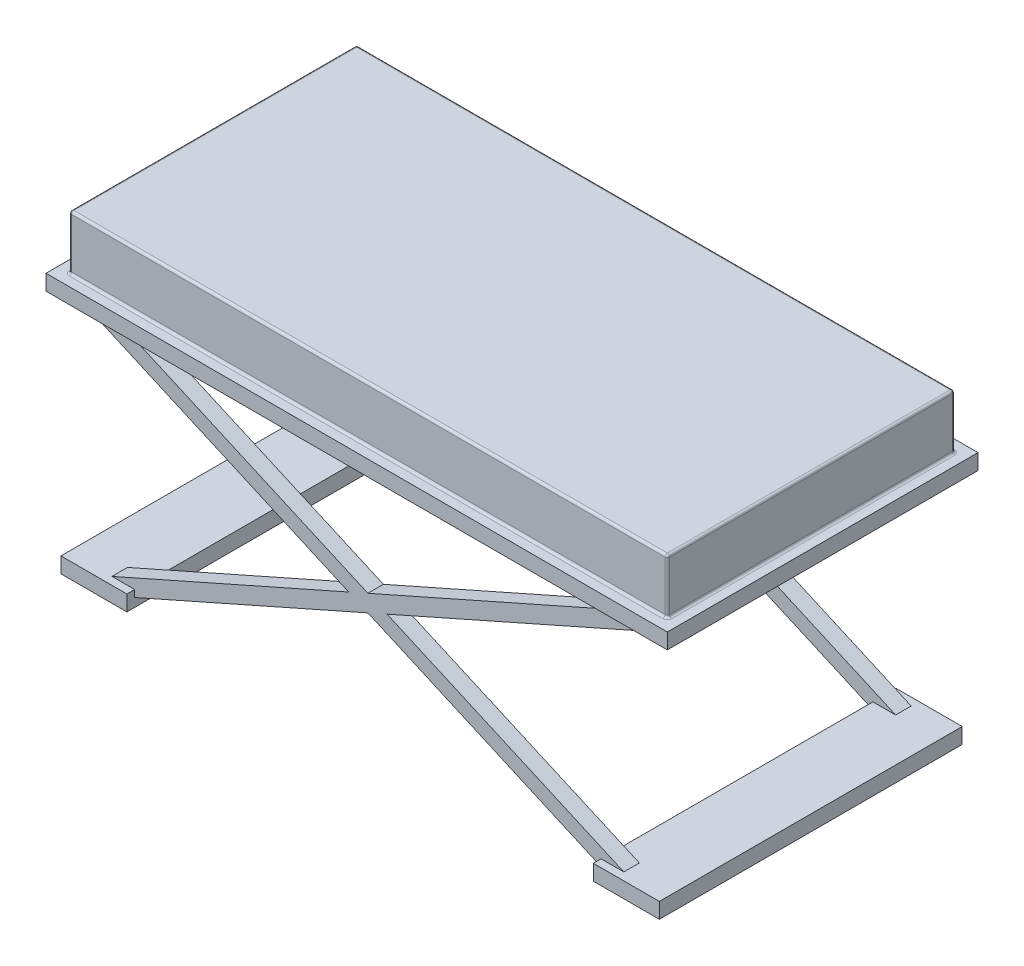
ISO-10303-21;
HEADER;
FILE_DESCRIPTION(('STEP AP214'),'2;1');
FILE_NAME('part.step','',(''),(''),'','','');
FILE_SCHEMA(('AUTOMOTIVE_DESIGN { 1 0 10303 214 1 1 1 1 }'));
ENDSEC;
DATA;
#1=APPLICATION_CONTEXT('core data for automotive mechanical design processes');
#2=APPLICATION_PROTOCOL_DEFINITION('international standard','automotive_design',2000,#1);
#3=PRODUCT_CONTEXT('',#1,'mechanical');
#4=PRODUCT('Part','Part','',(#3));
#5=PRODUCT_RELATED_PRODUCT_CATEGORY('part','',(#4));
#6=PRODUCT_DEFINITION_FORMATION('','',#4);
#7=PRODUCT_DEFINITION_CONTEXT('part definition',#1,'design');
#8=PRODUCT_DEFINITION('design','',#6,#7);
#9=PRODUCT_DEFINITION_SHAPE('','',#8);
#10=(LENGTH_UNIT() NAMED_UNIT(*) SI_UNIT(.MILLI.,.METRE.));
#11=(NAMED_UNIT(*) PLANE_ANGLE_UNIT() SI_UNIT($,.RADIAN.));
#12=(NAMED_UNIT(*) SI_UNIT($,.STERADIAN.) SOLID_ANGLE_UNIT());
#13=UNCERTAINTY_MEASURE_WITH_UNIT(LENGTH_MEASURE(1.E-05),#10,'distance_accuracy_value','');
#14=(GEOMETRIC_REPRESENTATION_CONTEXT(3) GLOBAL_UNCERTAINTY_ASSIGNED_CONTEXT((#13)) GLOBAL_UNIT_ASSIGNED_CONTEXT((#10,
#11,#12)) REPRESENTATION_CONTEXT('',''));
#15=CARTESIAN_POINT('',(0.,0.,0.));
#16=DIRECTION('',(0.,0.,1.));
#17=DIRECTION('',(1.,0.,0.));
#18=AXIS2_PLACEMENT_3D('',#15,#16,#17);
#19=CARTESIAN_POINT('',(0.,50.8,392.306418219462));
#20=DIRECTION('',(0.,0.,-1.));
#21=DIRECTION('',(-1.,0.,0.));
#22=AXIS2_PLACEMENT_3D('',#19,#20,#21);
#23=PLANE('',#22);
#24=DIRECTION('',(1.,0.,0.));
#25=VECTOR('',#24,1.);
#26=CARTESIAN_POINT('',(0.,0.,392.306418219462));
#27=LINE('',#26,#25);
#28=CARTESIAN_POINT('',(-856.132505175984,0.,392.306418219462));
#29=VERTEX_POINT('',#28);
#30=CARTESIAN_POINT('',(1175.86749482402,0.,392.306418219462));
#31=VERTEX_POINT('',#30);
#32=EDGE_CURVE('E688',#29,#31,#27,.T.);
#33=ORIENTED_EDGE('',*,*,#32,.T.);
#34=DIRECTION('',(0.,-1.,0.));
#35=VECTOR('',#34,1.);
#36=CARTESIAN_POINT('',(1175.86749482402,50.8,392.306418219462));
#37=LINE('',#36,#35);
#38=CARTESIAN_POINT('',(1175.86749482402,50.8,392.306418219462));
#39=VERTEX_POINT('',#38);
#40=EDGE_CURVE('E704',#39,#31,#37,.T.);
#41=ORIENTED_EDGE('',*,*,#40,.F.);
#42=DIRECTION('',(1.,0.,0.));
#43=VECTOR('',#42,1.);
#44=CARTESIAN_POINT('',(0.,50.8,392.306418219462));
#45=LINE('',#44,#43);
#46=CARTESIAN_POINT('',(-856.132505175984,50.8,392.306418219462));
#47=VERTEX_POINT('',#46);
#48=EDGE_CURVE('E675',#47,#39,#45,.T.);
#49=ORIENTED_EDGE('',*,*,#48,.F.);
#50=DIRECTION('',(0.,-1.,0.));
#51=VECTOR('',#50,1.);
#52=CARTESIAN_POINT('',(-856.132505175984,50.8,392.306418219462));
#53=LINE('',#52,#51);
#54=EDGE_CURVE('E687',#47,#29,#53,.T.);
#55=ORIENTED_EDGE('',*,*,#54,.T.);
#56=EDGE_LOOP('',(#33,#41,#49,#55));
#57=FACE_BOUND('',#56,.T.);
#58=ADVANCED_FACE('F49',(#57),#23,.F.);
#59=CARTESIAN_POINT('',(1175.86749482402,50.8,0.));
#60=DIRECTION('',(-1.,0.,0.));
#61=DIRECTION('',(0.,0.,1.));
#62=AXIS2_PLACEMENT_3D('',#59,#60,#61);
#63=PLANE('',#62);
#64=DIRECTION('',(0.,0.,-1.));
#65=VECTOR('',#64,1.);
#66=CARTESIAN_POINT('',(1175.86749482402,0.,0.));
#67=LINE('',#66,#65);
#68=CARTESIAN_POINT('',(1175.86749482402,0.,-623.693581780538));
#69=VERTEX_POINT('',#68);
#70=EDGE_CURVE('E691',#31,#69,#67,.T.);
#71=ORIENTED_EDGE('',*,*,#70,.T.);
#72=DIRECTION('',(0.,-1.,0.));
#73=VECTOR('',#72,1.);
#74=CARTESIAN_POINT('',(1175.86749482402,50.8,-623.693581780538));
#75=LINE('',#74,#73);
#76=CARTESIAN_POINT('',(1175.86749482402,50.8,-623.693581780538));
#77=VERTEX_POINT('',#76);
#78=EDGE_CURVE('E702',#77,#69,#75,.T.);
#79=ORIENTED_EDGE('',*,*,#78,.F.);
#80=DIRECTION('',(0.,0.,-1.));
#81=VECTOR('',#80,1.);
#82=CARTESIAN_POINT('',(1175.86749482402,50.8,0.));
#83=LINE('',#82,#81);
#84=EDGE_CURVE('E678',#39,#77,#83,.T.);
#85=ORIENTED_EDGE('',*,*,#84,.F.);
#86=ORIENTED_EDGE('',*,*,#40,.T.);
#87=EDGE_LOOP('',(#71,#79,#85,#86));
#88=FACE_BOUND('',#87,.T.);
#89=ADVANCED_FACE('F917',(#88),#63,.F.);
#90=CARTESIAN_POINT('',(0.,50.8,-623.693581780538));
#91=DIRECTION('',(0.,0.,-1.));
#92=DIRECTION('',(-1.,0.,0.));
#93=AXIS2_PLACEMENT_3D('',#90,#91,#92);
#94=PLANE('',#93);
#95=DIRECTION('',(1.,0.,0.));
#96=VECTOR('',#95,1.);
#97=CARTESIAN_POINT('',(0.,0.,-623.693581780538));
#98=LINE('',#97,#96);
#99=CARTESIAN_POINT('',(-856.132505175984,0.,-623.693581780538));
#100=VERTEX_POINT('',#99);
#101=EDGE_CURVE('E694',#100,#69,#98,.T.);
#102=ORIENTED_EDGE('',*,*,#101,.F.);
#103=DIRECTION('',(0.,-1.,0.));
#104=VECTOR('',#103,1.);
#105=CARTESIAN_POINT('',(-856.132505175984,50.8,-623.693581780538));
#106=LINE('',#105,#104);
#107=CARTESIAN_POINT('',(-856.132505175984,50.8,-623.693581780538));
#108=VERTEX_POINT('',#107);
#109=EDGE_CURVE('E700',#108,#100,#106,.T.);
#110=ORIENTED_EDGE('',*,*,#109,.F.);
#111=DIRECTION('',(1.,0.,0.));
#112=VECTOR('',#111,1.);
#113=CARTESIAN_POINT('',(0.,50.8,-623.693581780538));
#114=LINE('',#113,#112);
#115=EDGE_CURVE('E681',#108,#77,#114,.T.);
#116=ORIENTED_EDGE('',*,*,#115,.T.);
#117=ORIENTED_EDGE('',*,*,#78,.T.);
#118=EDGE_LOOP('',(#102,#110,#116,#117));
#119=FACE_BOUND('',#118,.T.);
#120=ADVANCED_FACE('F924',(#119),#94,.T.);
#121=CARTESIAN_POINT('',(-856.132505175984,50.8,0.));
#122=DIRECTION('',(-1.,0.,0.));
#123=DIRECTION('',(0.,0.,1.));
#124=AXIS2_PLACEMENT_3D('',#121,#122,#123);
#125=PLANE('',#124);
#126=DIRECTION('',(0.,0.,-1.));
#127=VECTOR('',#126,1.);
#128=CARTESIAN_POINT('',(-856.132505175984,0.,0.));
#129=LINE('',#128,#127);
#130=EDGE_CURVE('E679',#29,#100,#129,.T.);
#131=ORIENTED_EDGE('',*,*,#130,.F.);
#132=ORIENTED_EDGE('',*,*,#54,.F.);
#133=DIRECTION('',(0.,0.,-1.));
#134=VECTOR('',#133,1.);
#135=CARTESIAN_POINT('',(-856.132505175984,50.8,0.));
#136=LINE('',#135,#134);
#137=EDGE_CURVE('E684',#47,#108,#136,.T.);
#138=ORIENTED_EDGE('',*,*,#137,.T.);
#139=ORIENTED_EDGE('',*,*,#109,.T.);
#140=EDGE_LOOP('',(#131,#132,#138,#139));
#141=FACE_BOUND('',#140,.T.);
#142=ADVANCED_FACE('F1475',(#141),#125,.T.);
#143=CARTESIAN_POINT('',(0.,50.8,0.));
#144=DIRECTION('',(0.,1.,0.));
#145=DIRECTION('',(0.,0.,1.));
#146=AXIS2_PLACEMENT_3D('',#143,#144,#145);
#147=PLANE('',#146);
#148=CARTESIAN_POINT('',(-810.412505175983,50.8,346.586418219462));
#149=DIRECTION('',(0.,1.,0.));
#150=DIRECTION('',(0.,0.,1.));
#151=AXIS2_PLACEMENT_3D('',#148,#149,#150);
#152=CIRCLE('',#151,15.24);
#153=CARTESIAN_POINT('',(-825.652505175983,50.8,346.586418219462));
#154=VERTEX_POINT('',#153);
#155=CARTESIAN_POINT('',(-810.412505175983,50.8,361.826418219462));
#156=VERTEX_POINT('',#155);
#157=EDGE_CURVE('E716',#154,#156,#152,.T.);
#158=ORIENTED_EDGE('',*,*,#157,.F.);
#159=DIRECTION('',(0.,0.,1.));
#160=VECTOR('',#159,1.);
#161=CARTESIAN_POINT('',(-825.652505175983,50.8,-585.593581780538));
#162=LINE('',#161,#160);
#163=CARTESIAN_POINT('',(-825.652505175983,50.8,-577.973581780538));
#164=VERTEX_POINT('',#163);
#165=EDGE_CURVE('E734',#154,#164,#162,.F.);
#166=ORIENTED_EDGE('',*,*,#165,.T.);
#167=CARTESIAN_POINT('',(-810.412505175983,50.8,-577.973581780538));
#168=DIRECTION('',(0.,1.,0.));
#169=DIRECTION('',(0.,0.,1.));
#170=AXIS2_PLACEMENT_3D('',#167,#168,#169);
#171=CIRCLE('',#170,15.24);
#172=CARTESIAN_POINT('',(-810.412505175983,50.8,-593.213581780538));
#173=VERTEX_POINT('',#172);
#174=EDGE_CURVE('E731',#173,#164,#171,.T.);
#175=ORIENTED_EDGE('',*,*,#174,.F.);
#176=DIRECTION('',(-1.,0.,0.));
#177=VECTOR('',#176,1.);
#178=CARTESIAN_POINT('',(1137.76749482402,50.8,-593.213581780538));
#179=LINE('',#178,#177);
#180=CARTESIAN_POINT('',(1130.14749482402,50.8,-593.213581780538));
#181=VERTEX_POINT('',#180);
#182=EDGE_CURVE('E729',#173,#181,#179,.F.);
#183=ORIENTED_EDGE('',*,*,#182,.T.);
#184=CARTESIAN_POINT('',(1130.14749482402,50.8,-577.973581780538));
#185=DIRECTION('',(0.,1.,0.));
#186=DIRECTION('',(0.,0.,1.));
#187=AXIS2_PLACEMENT_3D('',#184,#185,#186);
#188=CIRCLE('',#187,15.24);
#189=CARTESIAN_POINT('',(1145.38749482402,50.8,-577.973581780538));
#190=VERTEX_POINT('',#189);
#191=EDGE_CURVE('E726',#190,#181,#188,.T.);
#192=ORIENTED_EDGE('',*,*,#191,.F.);
#193=DIRECTION('',(0.,0.,1.));
#194=VECTOR('',#193,1.);
#195=CARTESIAN_POINT('',(1145.38749482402,50.8,0.));
#196=LINE('',#195,#194);
#197=CARTESIAN_POINT('',(1145.38749482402,50.8,346.586418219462));
#198=VERTEX_POINT('',#197);
#199=EDGE_CURVE('E724',#190,#198,#196,.T.);
#200=ORIENTED_EDGE('',*,*,#199,.T.);
#201=CARTESIAN_POINT('',(1130.14749482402,50.8,346.586418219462));
#202=DIRECTION('',(0.,1.,0.));
#203=DIRECTION('',(0.,0.,1.));
#204=AXIS2_PLACEMENT_3D('',#201,#202,#203);
#205=CIRCLE('',#204,15.24);
#206=CARTESIAN_POINT('',(1130.14749482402,50.8,361.826418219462));
#207=VERTEX_POINT('',#206);
#208=EDGE_CURVE('E721',#207,#198,#205,.T.);
#209=ORIENTED_EDGE('',*,*,#208,.F.);
#210=DIRECTION('',(-1.,0.,0.));
#211=VECTOR('',#210,1.);
#212=CARTESIAN_POINT('',(0.,50.8,361.826418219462));
#213=LINE('',#212,#211);
#214=EDGE_CURVE('E719',#207,#156,#213,.T.);
#215=ORIENTED_EDGE('',*,*,#214,.T.);
#216=EDGE_LOOP('',(#158,#166,#175,#183,#192,#200,#209,#215));
#217=FACE_BOUND('',#216,.T.);
#218=ORIENTED_EDGE('',*,*,#48,.T.);
#219=ORIENTED_EDGE('',*,*,#84,.T.);
#220=ORIENTED_EDGE('',*,*,#115,.F.);
#221=ORIENTED_EDGE('',*,*,#137,.F.);
#222=EDGE_LOOP('',(#218,#219,#220,#221));
#223=FACE_BOUND('',#222,.T.);
#224=ADVANCED_FACE('F1112',(#217,#223),#147,.T.);
#225=CARTESIAN_POINT('',(0.,0.,0.));
#226=DIRECTION('',(0.,1.,0.));
#227=DIRECTION('',(0.,0.,1.));
#228=AXIS2_PLACEMENT_3D('',#225,#226,#227);
#229=PLANE('',#228);
#230=DIRECTION('',(0.,0.,-1.));
#231=VECTOR('',#230,1.);
#232=CARTESIAN_POINT('',(-791.859991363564,0.,-533.4));
#233=LINE('',#232,#231);
#234=CARTESIAN_POINT('',(-791.859991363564,0.,-533.4));
#235=VERTEX_POINT('',#234);
#236=CARTESIAN_POINT('',(-791.859991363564,0.,-584.2));
#237=VERTEX_POINT('',#236);
#238=EDGE_CURVE('E71',#235,#237,#233,.T.);
#239=ORIENTED_EDGE('',*,*,#238,.F.);
#240=DIRECTION('',(1.,0.,0.));
#241=VECTOR('',#240,1.);
#242=CARTESIAN_POINT('',(0.,-1.0511435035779E-12,-533.4));
#243=LINE('',#242,#241);
#244=CARTESIAN_POINT('',(-666.405018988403,0.,-533.4));
#245=VERTEX_POINT('',#244);
#246=EDGE_CURVE('E66',#235,#245,#243,.T.);
#247=ORIENTED_EDGE('',*,*,#246,.T.);
#248=DIRECTION('',(0.,0.,-1.));
#249=VECTOR('',#248,1.);
#250=CARTESIAN_POINT('',(-666.405018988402,-1.66533453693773E-13,-533.4));
#251=LINE('',#250,#249);
#252=CARTESIAN_POINT('',(-666.405018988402,-1.66533453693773E-13,-584.2));
#253=VERTEX_POINT('',#252);
#254=EDGE_CURVE('E565',#245,#253,#251,.T.);
#255=ORIENTED_EDGE('',*,*,#254,.T.);
#256=DIRECTION('',(1.,0.,0.));
#257=VECTOR('',#256,1.);
#258=CARTESIAN_POINT('',(0.,-1.0511435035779E-12,-584.2));
#259=LINE('',#258,#257);
#260=EDGE_CURVE('E508',#237,#253,#259,.T.);
#261=ORIENTED_EDGE('',*,*,#260,.F.);
#262=EDGE_LOOP('',(#239,#247,#255,#261));
#263=FACE_BOUND('',#262,.T.);
#264=DIRECTION('',(0.,0.,-1.));
#265=VECTOR('',#264,1.);
#266=CARTESIAN_POINT('',(986.140008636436,-1.11022302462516E-13,-533.4));
#267=LINE('',#266,#265);
#268=CARTESIAN_POINT('',(986.140008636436,0.,-533.4));
#269=VERTEX_POINT('',#268);
#270=CARTESIAN_POINT('',(986.140008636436,0.,-584.2));
#271=VERTEX_POINT('',#270);
#272=EDGE_CURVE('E502',#269,#271,#267,.T.);
#273=ORIENTED_EDGE('',*,*,#272,.F.);
#274=DIRECTION('',(1.,0.,0.));
#275=VECTOR('',#274,1.);
#276=CARTESIAN_POINT('',(0.,-9.83714171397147E-13,-533.4));
#277=LINE('',#276,#275);
#278=CARTESIAN_POINT('',(1111.5949810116,0.,-533.4));
#279=VERTEX_POINT('',#278);
#280=EDGE_CURVE('E500',#269,#279,#277,.T.);
#281=ORIENTED_EDGE('',*,*,#280,.T.);
#282=DIRECTION('',(0.,0.,-1.));
#283=VECTOR('',#282,1.);
#284=CARTESIAN_POINT('',(1111.5949810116,0.,-533.4));
#285=LINE('',#284,#283);
#286=CARTESIAN_POINT('',(1111.5949810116,0.,-584.2));
#287=VERTEX_POINT('',#286);
#288=EDGE_CURVE('E544',#279,#287,#285,.T.);
#289=ORIENTED_EDGE('',*,*,#288,.T.);
#290=DIRECTION('',(1.,0.,0.));
#291=VECTOR('',#290,1.);
#292=CARTESIAN_POINT('',(0.,-9.83714171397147E-13,-584.2));
#293=LINE('',#292,#291);
#294=EDGE_CURVE('E473',#271,#287,#293,.T.);
#295=ORIENTED_EDGE('',*,*,#294,.F.);
#296=EDGE_LOOP('',(#273,#281,#289,#295));
#297=FACE_BOUND('',#296,.T.);
#298=DIRECTION('',(0.,0.,-1.));
#299=VECTOR('',#298,1.);
#300=CARTESIAN_POINT('',(-791.859991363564,0.,355.6));
#301=LINE('',#300,#299);
#302=CARTESIAN_POINT('',(-791.859991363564,0.,355.6));
#303=VERTEX_POINT('',#302);
#304=CARTESIAN_POINT('',(-791.859991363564,0.,304.8));
#305=VERTEX_POINT('',#304);
#306=EDGE_CURVE('E667',#303,#305,#301,.T.);
#307=ORIENTED_EDGE('',*,*,#306,.F.);
#308=DIRECTION('',(1.,0.,0.));
#309=VECTOR('',#308,1.);
#310=CARTESIAN_POINT('',(0.,-1.0511435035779E-12,355.6));
#311=LINE('',#310,#309);
#312=CARTESIAN_POINT('',(-666.405018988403,0.,355.6));
#313=VERTEX_POINT('',#312);
#314=EDGE_CURVE('E577',#303,#313,#311,.T.);
#315=ORIENTED_EDGE('',*,*,#314,.T.);
#316=DIRECTION('',(0.,0.,-1.));
#317=VECTOR('',#316,1.);
#318=CARTESIAN_POINT('',(-666.405018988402,-1.66533453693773E-13,355.6));
#319=LINE('',#318,#317);
#320=CARTESIAN_POINT('',(-666.405018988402,-1.66533453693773E-13,304.8));
#321=VERTEX_POINT('',#320);
#322=EDGE_CURVE('E670',#313,#321,#319,.T.);
#323=ORIENTED_EDGE('',*,*,#322,.T.);
#324=DIRECTION('',(1.,0.,0.));
#325=VECTOR('',#324,1.);
#326=CARTESIAN_POINT('',(0.,-1.0511435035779E-12,304.8));
#327=LINE('',#326,#325);
#328=EDGE_CURVE('E611',#305,#321,#327,.T.);
#329=ORIENTED_EDGE('',*,*,#328,.F.);
#330=EDGE_LOOP('',(#307,#315,#323,#329));
#331=FACE_BOUND('',#330,.T.);
#332=DIRECTION('',(0.,0.,-1.));
#333=VECTOR('',#332,1.);
#334=CARTESIAN_POINT('',(986.140008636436,-1.11022302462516E-13,355.6));
#335=LINE('',#334,#333);
#336=CARTESIAN_POINT('',(986.140008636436,0.,355.6));
#337=VERTEX_POINT('',#336);
#338=CARTESIAN_POINT('',(986.140008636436,0.,304.8));
#339=VERTEX_POINT('',#338);
#340=EDGE_CURVE('E605',#337,#339,#335,.T.);
#341=ORIENTED_EDGE('',*,*,#340,.F.);
#342=DIRECTION('',(1.,0.,0.));
#343=VECTOR('',#342,1.);
#344=CARTESIAN_POINT('',(0.,-9.83714171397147E-13,355.6));
#345=LINE('',#344,#343);
#346=CARTESIAN_POINT('',(1111.5949810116,0.,355.6));
#347=VERTEX_POINT('',#346);
#348=EDGE_CURVE('E603',#337,#347,#345,.T.);
#349=ORIENTED_EDGE('',*,*,#348,.T.);
#350=DIRECTION('',(0.,0.,-1.));
#351=VECTOR('',#350,1.);
#352=CARTESIAN_POINT('',(1111.5949810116,0.,355.6));
#353=LINE('',#352,#351);
#354=CARTESIAN_POINT('',(1111.5949810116,0.,304.8));
#355=VERTEX_POINT('',#354);
#356=EDGE_CURVE('E647',#347,#355,#353,.T.);
#357=ORIENTED_EDGE('',*,*,#356,.T.);
#358=DIRECTION('',(1.,0.,0.));
#359=VECTOR('',#358,1.);
#360=CARTESIAN_POINT('',(0.,-9.83714171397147E-13,304.8));
#361=LINE('',#360,#359);
#362=EDGE_CURVE('E574',#339,#355,#361,.T.);
#363=ORIENTED_EDGE('',*,*,#362,.F.);
#364=EDGE_LOOP('',(#341,#349,#357,#363));
#365=FACE_BOUND('',#364,.T.);
#366=ORIENTED_EDGE('',*,*,#32,.F.);
#367=ORIENTED_EDGE('',*,*,#130,.T.);
#368=ORIENTED_EDGE('',*,*,#101,.T.);
#369=ORIENTED_EDGE('',*,*,#70,.F.);
#370=EDGE_LOOP('',(#366,#367,#368,#369));
#371=FACE_BOUND('',#370,.T.);
#372=ADVANCED_FACE('F1107',(#263,#297,#331,#365,#371),#229,.F.);
#373=CARTESIAN_POINT('',(-818.032505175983,228.6,354.206418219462));
#374=DIRECTION('',(-1.,0.,0.));
#375=DIRECTION('',(0.,0.,1.));
#376=AXIS2_PLACEMENT_3D('',#373,#374,#375);
#377=PLANE('',#376);
#378=DIRECTION('',(0.,-1.,0.));
#379=VECTOR('',#378,1.);
#380=CARTESIAN_POINT('',(-818.032505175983,228.6,-577.973581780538));
#381=LINE('',#380,#379);
#382=CARTESIAN_POINT('',(-818.032505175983,220.98,-577.973581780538));
#383=VERTEX_POINT('',#382);
#384=CARTESIAN_POINT('',(-818.032505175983,58.42,-577.973581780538));
#385=VERTEX_POINT('',#384);
#386=EDGE_CURVE('E711',#383,#385,#381,.T.);
#387=ORIENTED_EDGE('',*,*,#386,.T.);
#388=DIRECTION('',(0.,0.,1.));
#389=VECTOR('',#388,1.);
#390=CARTESIAN_POINT('',(-818.032505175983,58.42,354.206418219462));
#391=LINE('',#390,#389);
#392=CARTESIAN_POINT('',(-818.032505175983,58.42,346.586418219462));
#393=VERTEX_POINT('',#392);
#394=EDGE_CURVE('E713',#385,#393,#391,.T.);
#395=ORIENTED_EDGE('',*,*,#394,.T.);
#396=DIRECTION('',(0.,-1.,0.));
#397=VECTOR('',#396,1.);
#398=CARTESIAN_POINT('',(-818.032505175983,228.6,346.586418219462));
#399=LINE('',#398,#397);
#400=CARTESIAN_POINT('',(-818.032505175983,220.98,346.586418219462));
#401=VERTEX_POINT('',#400);
#402=EDGE_CURVE('E709',#393,#401,#399,.F.);
#403=ORIENTED_EDGE('',*,*,#402,.T.);
#404=DIRECTION('',(0.,0.,-1.));
#405=VECTOR('',#404,1.);
#406=CARTESIAN_POINT('',(-818.032505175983,220.98,-585.593581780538));
#407=LINE('',#406,#405);
#408=EDGE_CURVE('E707',#401,#383,#407,.T.);
#409=ORIENTED_EDGE('',*,*,#408,.T.);
#410=EDGE_LOOP('',(#387,#395,#403,#409));
#411=FACE_BOUND('',#410,.T.);
#412=ADVANCED_FACE('F1111',(#411),#377,.T.);
#413=CARTESIAN_POINT('',(-818.032505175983,228.6,354.206418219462));
#414=DIRECTION('',(0.,0.,-1.));
#415=DIRECTION('',(-1.,0.,0.));
#416=AXIS2_PLACEMENT_3D('',#413,#414,#415);
#417=PLANE('',#416);
#418=DIRECTION('',(0.,-1.,0.));
#419=VECTOR('',#418,1.);
#420=CARTESIAN_POINT('',(-810.412505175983,50.8,354.206418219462));
#421=LINE('',#420,#419);
#422=CARTESIAN_POINT('',(-810.412505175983,220.98,354.206418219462));
#423=VERTEX_POINT('',#422);
#424=CARTESIAN_POINT('',(-810.412505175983,58.42,354.206418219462));
#425=VERTEX_POINT('',#424);
#426=EDGE_CURVE('E759',#423,#425,#421,.T.);
#427=ORIENTED_EDGE('',*,*,#426,.T.);
#428=DIRECTION('',(-1.,0.,0.));
#429=VECTOR('',#428,1.);
#430=CARTESIAN_POINT('',(-818.032505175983,58.42,354.206418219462));
#431=LINE('',#430,#429);
#432=CARTESIAN_POINT('',(1130.14749482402,58.42,354.206418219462));
#433=VERTEX_POINT('',#432);
#434=EDGE_CURVE('E762',#425,#433,#431,.F.);
#435=ORIENTED_EDGE('',*,*,#434,.T.);
#436=DIRECTION('',(0.,-1.,0.));
#437=VECTOR('',#436,1.);
#438=CARTESIAN_POINT('',(1130.14749482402,228.6,354.206418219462));
#439=LINE('',#438,#437);
#440=CARTESIAN_POINT('',(1130.14749482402,220.98,354.206418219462));
#441=VERTEX_POINT('',#440);
#442=EDGE_CURVE('E757',#433,#441,#439,.F.);
#443=ORIENTED_EDGE('',*,*,#442,.T.);
#444=DIRECTION('',(1.,0.,0.));
#445=VECTOR('',#444,1.);
#446=CARTESIAN_POINT('',(-818.032505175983,220.98,354.206418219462));
#447=LINE('',#446,#445);
#448=EDGE_CURVE('E755',#441,#423,#447,.F.);
#449=ORIENTED_EDGE('',*,*,#448,.T.);
#450=EDGE_LOOP('',(#427,#435,#443,#449));
#451=FACE_BOUND('',#450,.T.);
#452=ADVANCED_FACE('F903',(#451),#417,.F.);
#453=CARTESIAN_POINT('',(1137.76749482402,228.6,354.206418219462));
#454=DIRECTION('',(-1.,0.,0.));
#455=DIRECTION('',(0.,0.,1.));
#456=AXIS2_PLACEMENT_3D('',#453,#454,#455);
#457=PLANE('',#456);
#458=DIRECTION('',(0.,0.,1.));
#459=VECTOR('',#458,1.);
#460=CARTESIAN_POINT('',(1137.76749482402,58.42,354.206418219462));
#461=LINE('',#460,#459);
#462=CARTESIAN_POINT('',(1137.76749482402,58.42,346.586418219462));
#463=VERTEX_POINT('',#462);
#464=CARTESIAN_POINT('',(1137.76749482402,58.42,-577.973581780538));
#465=VERTEX_POINT('',#464);
#466=EDGE_CURVE('E750',#463,#465,#461,.F.);
#467=ORIENTED_EDGE('',*,*,#466,.T.);
#468=DIRECTION('',(0.,-1.,0.));
#469=VECTOR('',#468,1.);
#470=CARTESIAN_POINT('',(1137.76749482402,228.6,-577.973581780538));
#471=LINE('',#470,#469);
#472=CARTESIAN_POINT('',(1137.76749482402,220.98,-577.973581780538));
#473=VERTEX_POINT('',#472);
#474=EDGE_CURVE('E752',#465,#473,#471,.F.);
#475=ORIENTED_EDGE('',*,*,#474,.T.);
#476=DIRECTION('',(0.,0.,-1.));
#477=VECTOR('',#476,1.);
#478=CARTESIAN_POINT('',(1137.76749482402,220.98,354.206418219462));
#479=LINE('',#478,#477);
#480=CARTESIAN_POINT('',(1137.76749482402,220.98,346.586418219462));
#481=VERTEX_POINT('',#480);
#482=EDGE_CURVE('E746',#473,#481,#479,.F.);
#483=ORIENTED_EDGE('',*,*,#482,.T.);
#484=DIRECTION('',(0.,-1.,0.));
#485=VECTOR('',#484,1.);
#486=CARTESIAN_POINT('',(1137.76749482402,228.6,346.586418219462));
#487=LINE('',#486,#485);
#488=EDGE_CURVE('E748',#481,#463,#487,.T.);
#489=ORIENTED_EDGE('',*,*,#488,.T.);
#490=EDGE_LOOP('',(#467,#475,#483,#489));
#491=FACE_BOUND('',#490,.T.);
#492=ADVANCED_FACE('F846',(#491),#457,.F.);
#493=CARTESIAN_POINT('',(-818.032505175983,228.6,-585.593581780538));
#494=DIRECTION('',(0.,0.,-1.));
#495=DIRECTION('',(-1.,0.,0.));
#496=AXIS2_PLACEMENT_3D('',#493,#494,#495);
#497=PLANE('',#496);
#498=DIRECTION('',(-1.,0.,0.));
#499=VECTOR('',#498,1.);
#500=CARTESIAN_POINT('',(-818.032505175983,58.42,-585.593581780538));
#501=LINE('',#500,#499);
#502=CARTESIAN_POINT('',(1130.14749482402,58.42,-585.593581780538));
#503=VERTEX_POINT('',#502);
#504=CARTESIAN_POINT('',(-810.412505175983,58.42,-585.593581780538));
#505=VERTEX_POINT('',#504);
#506=EDGE_CURVE('E741',#503,#505,#501,.T.);
#507=ORIENTED_EDGE('',*,*,#506,.T.);
#508=DIRECTION('',(0.,-1.,0.));
#509=VECTOR('',#508,1.);
#510=CARTESIAN_POINT('',(-810.412505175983,228.6,-585.593581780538));
#511=LINE('',#510,#509);
#512=CARTESIAN_POINT('',(-810.412505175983,220.98,-585.593581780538));
#513=VERTEX_POINT('',#512);
#514=EDGE_CURVE('E743',#505,#513,#511,.F.);
#515=ORIENTED_EDGE('',*,*,#514,.T.);
#516=DIRECTION('',(1.,0.,0.));
#517=VECTOR('',#516,1.);
#518=CARTESIAN_POINT('',(1137.76749482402,220.98,-585.593581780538));
#519=LINE('',#518,#517);
#520=CARTESIAN_POINT('',(1130.14749482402,220.98,-585.593581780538));
#521=VERTEX_POINT('',#520);
#522=EDGE_CURVE('E737',#513,#521,#519,.T.);
#523=ORIENTED_EDGE('',*,*,#522,.T.);
#524=DIRECTION('',(0.,-1.,0.));
#525=VECTOR('',#524,1.);
#526=CARTESIAN_POINT('',(1130.14749482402,50.8,-585.593581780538));
#527=LINE('',#526,#525);
#528=EDGE_CURVE('E739',#521,#503,#527,.T.);
#529=ORIENTED_EDGE('',*,*,#528,.T.);
#530=EDGE_LOOP('',(#507,#515,#523,#529));
#531=FACE_BOUND('',#530,.T.);
#532=ADVANCED_FACE('F867',(#531),#497,.T.);
#533=CARTESIAN_POINT('',(0.,228.6,0.));
#534=DIRECTION('',(0.,-1.,0.));
#535=DIRECTION('',(0.,0.,-1.));
#536=AXIS2_PLACEMENT_3D('',#533,#534,#535);
#537=PLANE('',#536);
#538=DIRECTION('',(0.,0.,-1.));
#539=VECTOR('',#538,1.);
#540=CARTESIAN_POINT('',(1130.14749482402,228.6,0.));
#541=LINE('',#540,#539);
#542=CARTESIAN_POINT('',(1130.14749482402,228.6,346.586418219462));
#543=VERTEX_POINT('',#542);
#544=CARTESIAN_POINT('',(1130.14749482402,228.6,-577.973581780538));
#545=VERTEX_POINT('',#544);
#546=EDGE_CURVE('E58',#543,#545,#541,.T.);
#547=ORIENTED_EDGE('',*,*,#546,.T.);
#548=DIRECTION('',(1.,0.,0.));
#549=VECTOR('',#548,1.);
#550=CARTESIAN_POINT('',(-818.032505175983,228.6,-577.973581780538));
#551=LINE('',#550,#549);
#552=CARTESIAN_POINT('',(-810.412505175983,228.6,-577.973581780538));
#553=VERTEX_POINT('',#552);
#554=EDGE_CURVE('E11',#545,#553,#551,.F.);
#555=ORIENTED_EDGE('',*,*,#554,.T.);
#556=DIRECTION('',(0.,0.,-1.));
#557=VECTOR('',#556,1.);
#558=CARTESIAN_POINT('',(-810.412505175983,228.6,354.206418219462));
#559=LINE('',#558,#557);
#560=CARTESIAN_POINT('',(-810.412505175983,228.6,346.586418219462));
#561=VERTEX_POINT('',#560);
#562=EDGE_CURVE('E764',#553,#561,#559,.F.);
#563=ORIENTED_EDGE('',*,*,#562,.T.);
#564=DIRECTION('',(1.,0.,0.));
#565=VECTOR('',#564,1.);
#566=CARTESIAN_POINT('',(0.,228.6,346.586418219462));
#567=LINE('',#566,#565);
#568=EDGE_CURVE('E766',#561,#543,#567,.T.);
#569=ORIENTED_EDGE('',*,*,#568,.T.);
#570=EDGE_LOOP('',(#547,#555,#563,#569));
#571=FACE_BOUND('',#570,.T.);
#572=ADVANCED_FACE('F883',(#571),#537,.F.);
#573=CARTESIAN_POINT('',(1130.14749482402,220.98,0.));
#574=DIRECTION('',(0.,0.,-1.));
#575=DIRECTION('',(-1.,0.,0.));
#576=AXIS2_PLACEMENT_3D('',#573,#574,#575);
#577=CYLINDRICAL_SURFACE('',#576,7.62);
#578=CARTESIAN_POINT('',(1130.14749482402,220.98,-577.973581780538));
#579=DIRECTION('',(0.,0.,-1.));
#580=DIRECTION('',(-1.,0.,0.));
#581=AXIS2_PLACEMENT_3D('',#578,#579,#580);
#582=CIRCLE('',#581,7.62);
#583=EDGE_CURVE('E53',#545,#473,#582,.T.);
#584=ORIENTED_EDGE('',*,*,#583,.F.);
#585=ORIENTED_EDGE('',*,*,#546,.F.);
#586=CARTESIAN_POINT('',(1130.14749482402,220.98,346.586418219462));
#587=DIRECTION('',(0.,0.,1.));
#588=DIRECTION('',(1.,0.,0.));
#589=AXIS2_PLACEMENT_3D('',#586,#587,#588);
#590=CIRCLE('',#589,7.62);
#591=EDGE_CURVE('E827',#481,#543,#590,.T.);
#592=ORIENTED_EDGE('',*,*,#591,.F.);
#593=ORIENTED_EDGE('',*,*,#482,.F.);
#594=EDGE_LOOP('',(#584,#585,#592,#593));
#595=FACE_BOUND('',#594,.T.);
#596=ADVANCED_FACE('F51',(#595),#577,.T.);
#597=CARTESIAN_POINT('',(1130.14749482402,220.98,-577.973581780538));
#598=DIRECTION('',(1.,0.,0.));
#599=DIRECTION('',(0.,0.,-1.));
#600=AXIS2_PLACEMENT_3D('',#597,#598,#599);
#601=SPHERICAL_SURFACE('',#600,7.62);
#602=CARTESIAN_POINT('',(1130.14749482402,220.98,-577.973581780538));
#603=DIRECTION('',(1.,0.,0.));
#604=DIRECTION('',(0.,0.,-1.));
#605=AXIS2_PLACEMENT_3D('',#602,#603,#604);
#606=CIRCLE('',#605,7.62);
#607=EDGE_CURVE('E823',#545,#521,#606,.F.);
#608=ORIENTED_EDGE('',*,*,#607,.F.);
#609=ORIENTED_EDGE('',*,*,#583,.T.);
#610=CARTESIAN_POINT('',(1130.14749482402,220.98,-577.973581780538));
#611=DIRECTION('',(0.,1.,0.));
#612=DIRECTION('',(0.,0.,1.));
#613=AXIS2_PLACEMENT_3D('',#610,#611,#612);
#614=CIRCLE('',#613,7.62);
#615=EDGE_CURVE('E826',#521,#473,#614,.F.);
#616=ORIENTED_EDGE('',*,*,#615,.F.);
#617=EDGE_LOOP('',(#608,#609,#616));
#618=FACE_BOUND('',#617,.T.);
#619=ADVANCED_FACE('F839',(#618),#601,.T.);
#620=CARTESIAN_POINT('',(1130.14749482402,220.98,346.586418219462));
#621=DIRECTION('',(0.,1.,0.));
#622=DIRECTION('',(0.,0.,1.));
#623=AXIS2_PLACEMENT_3D('',#620,#621,#622);
#624=SPHERICAL_SURFACE('',#623,7.62);
#625=CARTESIAN_POINT('',(1130.14749482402,220.98,346.586418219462));
#626=DIRECTION('',(0.,1.,0.));
#627=DIRECTION('',(0.,0.,1.));
#628=AXIS2_PLACEMENT_3D('',#625,#626,#627);
#629=CIRCLE('',#628,7.62);
#630=EDGE_CURVE('E817',#481,#441,#629,.F.);
#631=ORIENTED_EDGE('',*,*,#630,.F.);
#632=ORIENTED_EDGE('',*,*,#591,.T.);
#633=CARTESIAN_POINT('',(1130.14749482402,220.98,346.586418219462));
#634=DIRECTION('',(1.,0.,0.));
#635=DIRECTION('',(0.,0.,-1.));
#636=AXIS2_PLACEMENT_3D('',#633,#634,#635);
#637=CIRCLE('',#636,7.62);
#638=EDGE_CURVE('E820',#441,#543,#637,.F.);
#639=ORIENTED_EDGE('',*,*,#638,.F.);
#640=EDGE_LOOP('',(#631,#632,#639));
#641=FACE_BOUND('',#640,.T.);
#642=ADVANCED_FACE('F908',(#641),#624,.T.);
#643=CARTESIAN_POINT('',(1130.14749482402,228.6,-577.973581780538));
#644=DIRECTION('',(0.,1.,0.));
#645=DIRECTION('',(0.,0.,1.));
#646=AXIS2_PLACEMENT_3D('',#643,#644,#645);
#647=CYLINDRICAL_SURFACE('',#646,7.62);
#648=ORIENTED_EDGE('',*,*,#615,.T.);
#649=ORIENTED_EDGE('',*,*,#474,.F.);
#650=CARTESIAN_POINT('',(1130.14749482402,58.42,-577.973581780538));
#651=DIRECTION('',(0.,1.,0.));
#652=DIRECTION('',(0.,0.,1.));
#653=AXIS2_PLACEMENT_3D('',#650,#651,#652);
#654=CIRCLE('',#653,7.62);
#655=EDGE_CURVE('E811',#503,#465,#654,.F.);
#656=ORIENTED_EDGE('',*,*,#655,.F.);
#657=ORIENTED_EDGE('',*,*,#528,.F.);
#658=EDGE_LOOP('',(#648,#649,#656,#657));
#659=FACE_BOUND('',#658,.T.);
#660=ADVANCED_FACE('F851',(#659),#647,.T.);
#661=CARTESIAN_POINT('',(-818.032505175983,220.98,-577.973581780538));
#662=DIRECTION('',(-1.,0.,0.));
#663=DIRECTION('',(0.,0.,1.));
#664=AXIS2_PLACEMENT_3D('',#661,#662,#663);
#665=CYLINDRICAL_SURFACE('',#664,7.62);
#666=ORIENTED_EDGE('',*,*,#607,.T.);
#667=ORIENTED_EDGE('',*,*,#522,.F.);
#668=CARTESIAN_POINT('',(-810.412505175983,220.98,-577.973581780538));
#669=DIRECTION('',(-1.,0.,0.));
#670=DIRECTION('',(0.,0.,1.));
#671=AXIS2_PLACEMENT_3D('',#668,#669,#670);
#672=CIRCLE('',#671,7.62);
#673=EDGE_CURVE('E808',#553,#513,#672,.T.);
#674=ORIENTED_EDGE('',*,*,#673,.F.);
#675=ORIENTED_EDGE('',*,*,#554,.F.);
#676=EDGE_LOOP('',(#666,#667,#674,#675));
#677=FACE_BOUND('',#676,.T.);
#678=ADVANCED_FACE('F881',(#677),#665,.T.);
#679=CARTESIAN_POINT('',(-810.412505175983,220.98,354.206418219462));
#680=DIRECTION('',(0.,0.,1.));
#681=DIRECTION('',(1.,0.,0.));
#682=AXIS2_PLACEMENT_3D('',#679,#680,#681);
#683=CYLINDRICAL_SURFACE('',#682,7.62);
#684=CARTESIAN_POINT('',(-810.412505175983,220.98,346.586418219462));
#685=DIRECTION('',(0.,0.,1.));
#686=DIRECTION('',(1.,0.,0.));
#687=AXIS2_PLACEMENT_3D('',#684,#685,#686);
#688=CIRCLE('',#687,7.62);
#689=EDGE_CURVE('E803',#561,#401,#688,.T.);
#690=ORIENTED_EDGE('',*,*,#689,.F.);
#691=ORIENTED_EDGE('',*,*,#562,.F.);
#692=CARTESIAN_POINT('',(-810.412505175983,220.98,-577.973581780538));
#693=DIRECTION('',(0.,0.,-1.));
#694=DIRECTION('',(-1.,0.,0.));
#695=AXIS2_PLACEMENT_3D('',#692,#693,#694);
#696=CIRCLE('',#695,7.62);
#697=EDGE_CURVE('E806',#383,#553,#696,.T.);
#698=ORIENTED_EDGE('',*,*,#697,.F.);
#699=ORIENTED_EDGE('',*,*,#408,.F.);
#700=EDGE_LOOP('',(#690,#691,#698,#699));
#701=FACE_BOUND('',#700,.T.);
#702=ADVANCED_FACE('F893',(#701),#683,.T.);
#703=CARTESIAN_POINT('',(0.,220.98,346.586418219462));
#704=DIRECTION('',(1.,0.,0.));
#705=DIRECTION('',(0.,0.,-1.));
#706=AXIS2_PLACEMENT_3D('',#703,#704,#705);
#707=CYLINDRICAL_SURFACE('',#706,7.62);
#708=ORIENTED_EDGE('',*,*,#638,.T.);
#709=ORIENTED_EDGE('',*,*,#568,.F.);
#710=CARTESIAN_POINT('',(-810.412505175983,220.98,346.586418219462));
#711=DIRECTION('',(-1.,0.,0.));
#712=DIRECTION('',(0.,0.,1.));
#713=AXIS2_PLACEMENT_3D('',#710,#711,#712);
#714=CIRCLE('',#713,7.62);
#715=EDGE_CURVE('E800',#423,#561,#714,.T.);
#716=ORIENTED_EDGE('',*,*,#715,.F.);
#717=ORIENTED_EDGE('',*,*,#448,.F.);
#718=EDGE_LOOP('',(#708,#709,#716,#717));
#719=FACE_BOUND('',#718,.T.);
#720=ADVANCED_FACE('F888',(#719),#707,.T.);
#721=CARTESIAN_POINT('',(1130.14749482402,228.6,346.586418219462));
#722=DIRECTION('',(0.,-1.,0.));
#723=DIRECTION('',(0.,0.,-1.));
#724=AXIS2_PLACEMENT_3D('',#721,#722,#723);
#725=CYLINDRICAL_SURFACE('',#724,7.62);
#726=ORIENTED_EDGE('',*,*,#630,.T.);
#727=ORIENTED_EDGE('',*,*,#442,.F.);
#728=CARTESIAN_POINT('',(1130.14749482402,58.42,346.586418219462));
#729=DIRECTION('',(0.,1.,0.));
#730=DIRECTION('',(0.,0.,1.));
#731=AXIS2_PLACEMENT_3D('',#728,#729,#730);
#732=CIRCLE('',#731,7.62);
#733=EDGE_CURVE('E797',#463,#433,#732,.F.);
#734=ORIENTED_EDGE('',*,*,#733,.F.);
#735=ORIENTED_EDGE('',*,*,#488,.F.);
#736=EDGE_LOOP('',(#726,#727,#734,#735));
#737=FACE_BOUND('',#736,.T.);
#738=ADVANCED_FACE('F907',(#737),#725,.T.);
#739=CARTESIAN_POINT('',(1145.38749482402,58.42,0.));
#740=DIRECTION('',(0.,0.,1.));
#741=DIRECTION('',(1.,0.,0.));
#742=AXIS2_PLACEMENT_3D('',#739,#740,#741);
#743=CYLINDRICAL_SURFACE('',#742,7.62);
#744=CARTESIAN_POINT('',(1145.38749482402,58.42,346.586418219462));
#745=DIRECTION('',(0.,0.,-1.));
#746=DIRECTION('',(-1.,0.,0.));
#747=AXIS2_PLACEMENT_3D('',#744,#745,#746);
#748=CIRCLE('',#747,7.62);
#749=EDGE_CURVE('E794',#198,#463,#748,.T.);
#750=ORIENTED_EDGE('',*,*,#749,.F.);
#751=ORIENTED_EDGE('',*,*,#199,.F.);
#752=CARTESIAN_POINT('',(1145.38749482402,58.42,-577.973581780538));
#753=DIRECTION('',(0.,0.,1.));
#754=DIRECTION('',(1.,0.,0.));
#755=AXIS2_PLACEMENT_3D('',#752,#753,#754);
#756=CIRCLE('',#755,7.62);
#757=EDGE_CURVE('E814',#465,#190,#756,.T.);
#758=ORIENTED_EDGE('',*,*,#757,.F.);
#759=ORIENTED_EDGE('',*,*,#466,.F.);
#760=EDGE_LOOP('',(#750,#751,#758,#759));
#761=FACE_BOUND('',#760,.T.);
#762=ADVANCED_FACE('F856',(#761),#743,.F.);
#763=CARTESIAN_POINT('',(1130.14749482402,58.42,-577.973581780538));
#764=DIRECTION('',(0.,1.,0.));
#765=DIRECTION('',(0.,0.,1.));
#766=AXIS2_PLACEMENT_3D('',#763,#764,#765);
#767=TOROIDAL_SURFACE('',#766,15.24,7.62);
#768=ORIENTED_EDGE('',*,*,#757,.T.);
#769=ORIENTED_EDGE('',*,*,#191,.T.);
#770=CARTESIAN_POINT('',(1130.14749482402,58.42,-593.213581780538));
#771=DIRECTION('',(-1.,0.,0.));
#772=DIRECTION('',(0.,0.,1.));
#773=AXIS2_PLACEMENT_3D('',#770,#771,#772);
#774=CIRCLE('',#773,7.62);
#775=EDGE_CURVE('E791',#503,#181,#774,.F.);
#776=ORIENTED_EDGE('',*,*,#775,.F.);
#777=ORIENTED_EDGE('',*,*,#655,.T.);
#778=EDGE_LOOP('',(#768,#769,#776,#777));
#779=FACE_BOUND('',#778,.T.);
#780=ADVANCED_FACE('F859',(#779),#767,.F.);
#781=CARTESIAN_POINT('',(-810.412505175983,220.98,-577.973581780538));
#782=DIRECTION('',(0.,1.,0.));
#783=DIRECTION('',(0.,0.,1.));
#784=AXIS2_PLACEMENT_3D('',#781,#782,#783);
#785=SPHERICAL_SURFACE('',#784,7.62);
#786=ORIENTED_EDGE('',*,*,#697,.T.);
#787=ORIENTED_EDGE('',*,*,#673,.T.);
#788=CARTESIAN_POINT('',(-810.412505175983,220.98,-577.973581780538));
#789=DIRECTION('',(0.,1.,0.));
#790=DIRECTION('',(0.,0.,1.));
#791=AXIS2_PLACEMENT_3D('',#788,#789,#790);
#792=CIRCLE('',#791,7.62);
#793=EDGE_CURVE('E789',#383,#513,#792,.F.);
#794=ORIENTED_EDGE('',*,*,#793,.F.);
#795=EDGE_LOOP('',(#786,#787,#794));
#796=FACE_BOUND('',#795,.T.);
#797=ADVANCED_FACE('F877',(#796),#785,.T.);
#798=CARTESIAN_POINT('',(-810.412505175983,220.98,346.586418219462));
#799=DIRECTION('',(0.,1.,0.));
#800=DIRECTION('',(0.,0.,1.));
#801=AXIS2_PLACEMENT_3D('',#798,#799,#800);
#802=SPHERICAL_SURFACE('',#801,7.62);
#803=ORIENTED_EDGE('',*,*,#715,.T.);
#804=ORIENTED_EDGE('',*,*,#689,.T.);
#805=CARTESIAN_POINT('',(-810.412505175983,220.98,346.586418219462));
#806=DIRECTION('',(0.,1.,0.));
#807=DIRECTION('',(0.,0.,1.));
#808=AXIS2_PLACEMENT_3D('',#805,#806,#807);
#809=CIRCLE('',#808,7.62);
#810=EDGE_CURVE('E786',#423,#401,#809,.F.);
#811=ORIENTED_EDGE('',*,*,#810,.F.);
#812=EDGE_LOOP('',(#803,#804,#811));
#813=FACE_BOUND('',#812,.T.);
#814=ADVANCED_FACE('F895',(#813),#802,.T.);
#815=CARTESIAN_POINT('',(1130.14749482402,58.42,346.586418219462));
#816=DIRECTION('',(0.,1.,0.));
#817=DIRECTION('',(0.,0.,1.));
#818=AXIS2_PLACEMENT_3D('',#815,#816,#817);
#819=TOROIDAL_SURFACE('',#818,15.24,7.62);
#820=ORIENTED_EDGE('',*,*,#749,.T.);
#821=ORIENTED_EDGE('',*,*,#733,.T.);
#822=CARTESIAN_POINT('',(1130.14749482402,58.42,361.826418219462));
#823=DIRECTION('',(-1.,0.,0.));
#824=DIRECTION('',(0.,0.,1.));
#825=AXIS2_PLACEMENT_3D('',#822,#823,#824);
#826=CIRCLE('',#825,7.62);
#827=EDGE_CURVE('E783',#207,#433,#826,.F.);
#828=ORIENTED_EDGE('',*,*,#827,.F.);
#829=ORIENTED_EDGE('',*,*,#208,.T.);
#830=EDGE_LOOP('',(#820,#821,#828,#829));
#831=FACE_BOUND('',#830,.T.);
#832=ADVANCED_FACE('F952',(#831),#819,.F.);
#833=CARTESIAN_POINT('',(-818.032505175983,58.42,-593.213581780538));
#834=DIRECTION('',(1.,0.,0.));
#835=DIRECTION('',(0.,0.,-1.));
#836=AXIS2_PLACEMENT_3D('',#833,#834,#835);
#837=CYLINDRICAL_SURFACE('',#836,7.62);
#838=ORIENTED_EDGE('',*,*,#775,.T.);
#839=ORIENTED_EDGE('',*,*,#182,.F.);
#840=CARTESIAN_POINT('',(-810.412505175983,58.42,-593.213581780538));
#841=DIRECTION('',(1.,0.,0.));
#842=DIRECTION('',(0.,0.,-1.));
#843=AXIS2_PLACEMENT_3D('',#840,#841,#842);
#844=CIRCLE('',#843,7.62);
#845=EDGE_CURVE('E780',#505,#173,#844,.T.);
#846=ORIENTED_EDGE('',*,*,#845,.F.);
#847=ORIENTED_EDGE('',*,*,#506,.F.);
#848=EDGE_LOOP('',(#838,#839,#846,#847));
#849=FACE_BOUND('',#848,.T.);
#850=ADVANCED_FACE('F864',(#849),#837,.F.);
#851=CARTESIAN_POINT('',(-810.412505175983,228.6,-577.973581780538));
#852=DIRECTION('',(0.,-1.,0.));
#853=DIRECTION('',(0.,0.,-1.));
#854=AXIS2_PLACEMENT_3D('',#851,#852,#853);
#855=CYLINDRICAL_SURFACE('',#854,7.62);
#856=ORIENTED_EDGE('',*,*,#793,.T.);
#857=ORIENTED_EDGE('',*,*,#514,.F.);
#858=CARTESIAN_POINT('',(-810.412505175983,58.42,-577.973581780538));
#859=DIRECTION('',(0.,1.,0.));
#860=DIRECTION('',(0.,0.,1.));
#861=AXIS2_PLACEMENT_3D('',#858,#859,#860);
#862=CIRCLE('',#861,7.62);
#863=EDGE_CURVE('E777',#385,#505,#862,.F.);
#864=ORIENTED_EDGE('',*,*,#863,.F.);
#865=ORIENTED_EDGE('',*,*,#386,.F.);
#866=EDGE_LOOP('',(#856,#857,#864,#865));
#867=FACE_BOUND('',#866,.T.);
#868=ADVANCED_FACE('F870',(#867),#855,.T.);
#869=CARTESIAN_POINT('',(-810.412505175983,228.6,346.586418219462));
#870=DIRECTION('',(0.,1.,0.));
#871=DIRECTION('',(0.,0.,1.));
#872=AXIS2_PLACEMENT_3D('',#869,#870,#871);
#873=CYLINDRICAL_SURFACE('',#872,7.62);
#874=ORIENTED_EDGE('',*,*,#810,.T.);
#875=ORIENTED_EDGE('',*,*,#402,.F.);
#876=CARTESIAN_POINT('',(-810.412505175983,58.42,346.586418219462));
#877=DIRECTION('',(0.,1.,0.));
#878=DIRECTION('',(0.,0.,1.));
#879=AXIS2_PLACEMENT_3D('',#876,#877,#878);
#880=CIRCLE('',#879,7.62);
#881=EDGE_CURVE('E774',#425,#393,#880,.F.);
#882=ORIENTED_EDGE('',*,*,#881,.F.);
#883=ORIENTED_EDGE('',*,*,#426,.F.);
#884=EDGE_LOOP('',(#874,#875,#882,#883));
#885=FACE_BOUND('',#884,.T.);
#886=ADVANCED_FACE('F900',(#885),#873,.T.);
#887=CARTESIAN_POINT('',(0.,58.42,361.826418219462));
#888=DIRECTION('',(-1.,0.,0.));
#889=DIRECTION('',(0.,0.,1.));
#890=AXIS2_PLACEMENT_3D('',#887,#888,#889);
#891=CYLINDRICAL_SURFACE('',#890,7.62);
#892=ORIENTED_EDGE('',*,*,#827,.T.);
#893=ORIENTED_EDGE('',*,*,#434,.F.);
#894=CARTESIAN_POINT('',(-810.412505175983,58.42,361.826418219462));
#895=DIRECTION('',(1.,0.,0.));
#896=DIRECTION('',(0.,0.,-1.));
#897=AXIS2_PLACEMENT_3D('',#894,#895,#896);
#898=CIRCLE('',#897,7.62);
#899=EDGE_CURVE('E772',#156,#425,#898,.T.);
#900=ORIENTED_EDGE('',*,*,#899,.F.);
#901=ORIENTED_EDGE('',*,*,#214,.F.);
#902=EDGE_LOOP('',(#892,#893,#900,#901));
#903=FACE_BOUND('',#902,.T.);
#904=ADVANCED_FACE('F941',(#903),#891,.F.);
#905=CARTESIAN_POINT('',(-810.412505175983,58.42,-577.973581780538));
#906=DIRECTION('',(0.,1.,0.));
#907=DIRECTION('',(0.,0.,1.));
#908=AXIS2_PLACEMENT_3D('',#905,#906,#907);
#909=TOROIDAL_SURFACE('',#908,15.24,7.62);
#910=ORIENTED_EDGE('',*,*,#845,.T.);
#911=ORIENTED_EDGE('',*,*,#174,.T.);
#912=CARTESIAN_POINT('',(-825.652505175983,58.42,-577.973581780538));
#913=DIRECTION('',(0.,0.,1.));
#914=DIRECTION('',(1.,0.,0.));
#915=AXIS2_PLACEMENT_3D('',#912,#913,#914);
#916=CIRCLE('',#915,7.62);
#917=EDGE_CURVE('E770',#385,#164,#916,.F.);
#918=ORIENTED_EDGE('',*,*,#917,.F.);
#919=ORIENTED_EDGE('',*,*,#863,.T.);
#920=EDGE_LOOP('',(#910,#911,#918,#919));
#921=FACE_BOUND('',#920,.T.);
#922=ADVANCED_FACE('F937',(#921),#909,.F.);
#923=CARTESIAN_POINT('',(-810.412505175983,58.42,346.586418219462));
#924=DIRECTION('',(0.,1.,0.));
#925=DIRECTION('',(0.,0.,1.));
#926=AXIS2_PLACEMENT_3D('',#923,#924,#925);
#927=TOROIDAL_SURFACE('',#926,15.24,7.62);
#928=ORIENTED_EDGE('',*,*,#899,.T.);
#929=ORIENTED_EDGE('',*,*,#881,.T.);
#930=CARTESIAN_POINT('',(-825.652505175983,58.42,346.586418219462));
#931=DIRECTION('',(0.,0.,-1.));
#932=DIRECTION('',(-1.,0.,0.));
#933=AXIS2_PLACEMENT_3D('',#930,#931,#932);
#934=CIRCLE('',#933,7.62);
#935=EDGE_CURVE('E674',#154,#393,#934,.F.);
#936=ORIENTED_EDGE('',*,*,#935,.F.);
#937=ORIENTED_EDGE('',*,*,#157,.T.);
#938=EDGE_LOOP('',(#928,#929,#936,#937));
#939=FACE_BOUND('',#938,.T.);
#940=ADVANCED_FACE('F933',(#939),#927,.F.);
#941=CARTESIAN_POINT('',(-825.652505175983,58.42,354.206418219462));
#942=DIRECTION('',(0.,0.,-1.));
#943=DIRECTION('',(-1.,0.,0.));
#944=AXIS2_PLACEMENT_3D('',#941,#942,#943);
#945=CYLINDRICAL_SURFACE('',#944,7.62);
#946=ORIENTED_EDGE('',*,*,#917,.T.);
#947=ORIENTED_EDGE('',*,*,#165,.F.);
#948=ORIENTED_EDGE('',*,*,#935,.T.);
#949=ORIENTED_EDGE('',*,*,#394,.F.);
#950=EDGE_LOOP('',(#946,#947,#948,#949));
#951=FACE_BOUND('',#950,.T.);
#952=ADVANCED_FACE('F929',(#951),#945,.F.);
#953=CARTESIAN_POINT('',(161.692637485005,-365.112407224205,355.6));
#954=DIRECTION('',(-0.404926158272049,0.914349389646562,0.));
#955=DIRECTION('',(-0.914349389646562,-0.404926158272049,0.));
#956=AXIS2_PLACEMENT_3D('',#953,#954,#955);
#957=PLANE('',#956);
#958=DIRECTION('',(0.914349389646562,0.404926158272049,0.));
#959=VECTOR('',#958,1.);
#960=CARTESIAN_POINT('',(161.692637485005,-365.112407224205,304.8));
#961=LINE('',#960,#959);
#962=CARTESIAN_POINT('',(159.867494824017,-365.920684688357,304.8));
#963=VERTEX_POINT('',#962);
#964=EDGE_CURVE('E569',#963,#339,#961,.T.);
#965=ORIENTED_EDGE('',*,*,#964,.F.);
#966=DIRECTION('',(0.,0.,-1.));
#967=VECTOR('',#966,1.);
#968=CARTESIAN_POINT('',(159.867494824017,-365.920684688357,355.6));
#969=LINE('',#968,#967);
#970=CARTESIAN_POINT('',(159.867494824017,-365.920684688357,355.6));
#971=VERTEX_POINT('',#970);
#972=EDGE_CURVE('E672',#971,#963,#969,.T.);
#973=ORIENTED_EDGE('',*,*,#972,.F.);
#974=DIRECTION('',(0.914349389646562,0.404926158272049,0.));
#975=VECTOR('',#974,1.);
#976=CARTESIAN_POINT('',(161.692637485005,-365.112407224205,355.6));
#977=LINE('',#976,#975);
#978=EDGE_CURVE('E570',#971,#337,#977,.T.);
#979=ORIENTED_EDGE('',*,*,#978,.T.);
#980=ORIENTED_EDGE('',*,*,#340,.T.);
#981=EDGE_LOOP('',(#965,#973,#979,#980));
#982=FACE_BOUND('',#981,.T.);
#983=ADVANCED_FACE('F932',(#982),#957,.T.);
#984=CARTESIAN_POINT('',(-109.267227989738,-246.732450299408,355.6));
#985=DIRECTION('',(-0.404926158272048,-0.914349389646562,0.));
#986=DIRECTION('',(0.914349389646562,-0.404926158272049,0.));
#987=AXIS2_PLACEMENT_3D('',#984,#985,#986);
#988=PLANE('',#987);
#989=DIRECTION('',(-0.914349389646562,0.404926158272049,0.));
#990=VECTOR('',#989,1.);
#991=CARTESIAN_POINT('',(-109.267227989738,-246.732450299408,304.8));
#992=LINE('',#991,#990);
#993=EDGE_CURVE('E608',#963,#321,#992,.T.);
#994=ORIENTED_EDGE('',*,*,#993,.T.);
#995=ORIENTED_EDGE('',*,*,#322,.F.);
#996=DIRECTION('',(-0.914349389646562,0.404926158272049,0.));
#997=VECTOR('',#996,1.);
#998=CARTESIAN_POINT('',(-109.267227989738,-246.732450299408,355.6));
#999=LINE('',#998,#997);
#1000=EDGE_CURVE('E573',#971,#313,#999,.T.);
#1001=ORIENTED_EDGE('',*,*,#1000,.F.);
#1002=ORIENTED_EDGE('',*,*,#972,.T.);
#1003=EDGE_LOOP('',(#994,#995,#1001,#1002));
#1004=FACE_BOUND('',#1003,.T.);
#1005=ADVANCED_FACE('F1064',(#1004),#988,.F.);
#1006=CARTESIAN_POINT('',(-129.837476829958,-293.181399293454,355.6));
#1007=DIRECTION('',(-0.404926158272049,-0.914349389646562,0.));
#1008=DIRECTION('',(0.914349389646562,-0.404926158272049,0.));
#1009=AXIS2_PLACEMENT_3D('',#1006,#1007,#1008);
#1010=PLANE('',#1009);
#1011=DIRECTION('',(-0.914349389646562,0.404926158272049,0.));
#1012=VECTOR('',#1011,1.);
#1013=CARTESIAN_POINT('',(-129.837476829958,-293.181399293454,304.8));
#1014=LINE('',#1013,#1012);
#1015=CARTESIAN_POINT('',(97.1400086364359,-393.7,304.8));
#1016=VERTEX_POINT('',#1015);
#1017=EDGE_CURVE('E614',#1016,#305,#1014,.T.);
#1018=ORIENTED_EDGE('',*,*,#1017,.F.);
#1019=DIRECTION('',(0.,0.,-1.));
#1020=VECTOR('',#1019,1.);
#1021=CARTESIAN_POINT('',(97.1400086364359,-393.7,355.6));
#1022=LINE('',#1021,#1020);
#1023=CARTESIAN_POINT('',(97.1400086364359,-393.7,355.6));
#1024=VERTEX_POINT('',#1023);
#1025=EDGE_CURVE('E665',#1024,#1016,#1022,.T.);
#1026=ORIENTED_EDGE('',*,*,#1025,.F.);
#1027=DIRECTION('',(-0.914349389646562,0.404926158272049,0.));
#1028=VECTOR('',#1027,1.);
#1029=CARTESIAN_POINT('',(-129.837476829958,-293.181399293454,355.6));
#1030=LINE('',#1029,#1028);
#1031=EDGE_CURVE('E579',#1024,#303,#1030,.T.);
#1032=ORIENTED_EDGE('',*,*,#1031,.T.);
#1033=ORIENTED_EDGE('',*,*,#306,.T.);
#1034=EDGE_LOOP('',(#1018,#1026,#1032,#1033));
#1035=FACE_BOUND('',#1034,.T.);
#1036=ADVANCED_FACE('F1075',(#1035),#1010,.T.);
#1037=CARTESIAN_POINT('',(161.692637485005,-365.112407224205,355.6));
#1038=DIRECTION('',(-0.404926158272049,0.914349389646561,0.));
#1039=DIRECTION('',(-0.914349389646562,-0.404926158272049,0.));
#1040=AXIS2_PLACEMENT_3D('',#1037,#1038,#1039);
#1041=PLANE('',#1040);
#1042=DIRECTION('',(0.914349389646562,0.404926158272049,0.));
#1043=VECTOR('',#1042,1.);
#1044=CARTESIAN_POINT('',(161.692637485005,-365.112407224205,304.8));
#1045=LINE('',#1044,#1043);
#1046=CARTESIAN_POINT('',(-677.150313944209,-736.6,304.8));
#1047=VERTEX_POINT('',#1046);
#1048=EDGE_CURVE('E617',#1047,#1016,#1045,.T.);
#1049=ORIENTED_EDGE('',*,*,#1048,.F.);
#1050=DIRECTION('',(0.,0.,-1.));
#1051=VECTOR('',#1050,1.);
#1052=CARTESIAN_POINT('',(-677.150313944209,-736.6,355.6));
#1053=LINE('',#1052,#1051);
#1054=CARTESIAN_POINT('',(-677.150313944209,-736.6,355.6));
#1055=VERTEX_POINT('',#1054);
#1056=EDGE_CURVE('E663',#1055,#1047,#1053,.T.);
#1057=ORIENTED_EDGE('',*,*,#1056,.F.);
#1058=DIRECTION('',(0.914349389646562,0.404926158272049,0.));
#1059=VECTOR('',#1058,1.);
#1060=CARTESIAN_POINT('',(161.692637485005,-365.112407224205,355.6));
#1061=LINE('',#1060,#1059);
#1062=EDGE_CURVE('E582',#1055,#1024,#1061,.T.);
#1063=ORIENTED_EDGE('',*,*,#1062,.T.);
#1064=ORIENTED_EDGE('',*,*,#1025,.T.);
#1065=EDGE_LOOP('',(#1049,#1057,#1063,#1064));
#1066=FACE_BOUND('',#1065,.T.);
#1067=ADVANCED_FACE('F1084',(#1066),#1041,.T.);
#1068=CARTESIAN_POINT('',(182.262886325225,-411.56135621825,355.6));
#1069=DIRECTION('',(-0.404926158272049,0.914349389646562,0.));
#1070=DIRECTION('',(-0.914349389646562,-0.404926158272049,0.));
#1071=AXIS2_PLACEMENT_3D('',#1068,#1069,#1070);
#1072=PLANE('',#1071);
#1073=DIRECTION('',(0.914349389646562,0.404926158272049,0.));
#1074=VECTOR('',#1073,1.);
#1075=CARTESIAN_POINT('',(182.262886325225,-411.56135621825,304.8));
#1076=LINE('',#1075,#1074);
#1077=CARTESIAN_POINT('',(-602.780883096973,-759.223596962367,304.8));
#1078=VERTEX_POINT('',#1077);
#1079=CARTESIAN_POINT('',(159.867494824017,-421.479315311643,304.8));
#1080=VERTEX_POINT('',#1079);
#1081=EDGE_CURVE('E626',#1078,#1080,#1076,.T.);
#1082=ORIENTED_EDGE('',*,*,#1081,.T.);
#1083=DIRECTION('',(0.,0.,-1.));
#1084=VECTOR('',#1083,1.);
#1085=CARTESIAN_POINT('',(159.867494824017,-421.479315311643,355.6));
#1086=LINE('',#1085,#1084);
#1087=CARTESIAN_POINT('',(159.867494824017,-421.479315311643,355.6));
#1088=VERTEX_POINT('',#1087);
#1089=EDGE_CURVE('E658',#1088,#1080,#1086,.T.);
#1090=ORIENTED_EDGE('',*,*,#1089,.F.);
#1091=DIRECTION('',(0.914349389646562,0.404926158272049,0.));
#1092=VECTOR('',#1091,1.);
#1093=CARTESIAN_POINT('',(182.262886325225,-411.56135621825,355.6));
#1094=LINE('',#1093,#1092);
#1095=CARTESIAN_POINT('',(-602.780883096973,-759.223596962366,355.6));
#1096=VERTEX_POINT('',#1095);
#1097=EDGE_CURVE('E589',#1096,#1088,#1094,.T.);
#1098=ORIENTED_EDGE('',*,*,#1097,.F.);
#1099=DIRECTION('',(0.,0.,-1.));
#1100=VECTOR('',#1099,1.);
#1101=CARTESIAN_POINT('',(-602.780883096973,-759.223596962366,355.6));
#1102=LINE('',#1101,#1100);
#1103=EDGE_CURVE('E660',#1096,#1078,#1102,.T.);
#1104=ORIENTED_EDGE('',*,*,#1103,.T.);
#1105=EDGE_LOOP('',(#1082,#1090,#1098,#1104));
#1106=FACE_BOUND('',#1105,.T.);
#1107=ADVANCED_FACE('F1167',(#1106),#1072,.F.);
#1108=CARTESIAN_POINT('',(-129.837476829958,-293.181399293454,355.6));
#1109=DIRECTION('',(-0.404926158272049,-0.914349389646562,0.));
#1110=DIRECTION('',(0.914349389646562,-0.404926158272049,0.));
#1111=AXIS2_PLACEMENT_3D('',#1108,#1109,#1110);
#1112=PLANE('',#1111);
#1113=DIRECTION('',(-0.914349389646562,0.404926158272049,0.));
#1114=VECTOR('',#1113,1.);
#1115=CARTESIAN_POINT('',(-129.837476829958,-293.181399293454,304.8));
#1116=LINE('',#1115,#1114);
#1117=CARTESIAN_POINT('',(922.515872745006,-759.223596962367,304.8));
#1118=VERTEX_POINT('',#1117);
#1119=EDGE_CURVE('E629',#1118,#1080,#1116,.T.);
#1120=ORIENTED_EDGE('',*,*,#1119,.F.);
#1121=DIRECTION('',(0.,0.,-1.));
#1122=VECTOR('',#1121,1.);
#1123=CARTESIAN_POINT('',(922.515872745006,-759.223596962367,355.6));
#1124=LINE('',#1123,#1122);
#1125=CARTESIAN_POINT('',(922.515872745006,-759.223596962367,355.6));
#1126=VERTEX_POINT('',#1125);
#1127=EDGE_CURVE('E655',#1126,#1118,#1124,.T.);
#1128=ORIENTED_EDGE('',*,*,#1127,.F.);
#1129=DIRECTION('',(-0.914349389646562,0.404926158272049,0.));
#1130=VECTOR('',#1129,1.);
#1131=CARTESIAN_POINT('',(-129.837476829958,-293.181399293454,355.6));
#1132=LINE('',#1131,#1130);
#1133=EDGE_CURVE('E591',#1126,#1088,#1132,.T.);
#1134=ORIENTED_EDGE('',*,*,#1133,.T.);
#1135=ORIENTED_EDGE('',*,*,#1089,.T.);
#1136=EDGE_LOOP('',(#1120,#1128,#1134,#1135));
#1137=FACE_BOUND('',#1136,.T.);
#1138=ADVANCED_FACE('F1177',(#1137),#1112,.T.);
#1139=CARTESIAN_POINT('',(-109.267227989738,-246.732450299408,355.6));
#1140=DIRECTION('',(-0.404926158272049,-0.914349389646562,0.));
#1141=DIRECTION('',(0.914349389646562,-0.404926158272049,0.));
#1142=AXIS2_PLACEMENT_3D('',#1139,#1140,#1141);
#1143=PLANE('',#1142);
#1144=DIRECTION('',(-0.914349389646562,0.404926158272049,0.));
#1145=VECTOR('',#1144,1.);
#1146=CARTESIAN_POINT('',(-109.267227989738,-246.732450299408,304.8));
#1147=LINE('',#1146,#1145);
#1148=CARTESIAN_POINT('',(996.885303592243,-736.6,304.8));
#1149=VERTEX_POINT('',#1148);
#1150=CARTESIAN_POINT('',(222.594981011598,-393.7,304.8));
#1151=VERTEX_POINT('',#1150);
#1152=EDGE_CURVE('E638',#1149,#1151,#1147,.T.);
#1153=ORIENTED_EDGE('',*,*,#1152,.T.);
#1154=DIRECTION('',(0.,0.,-1.));
#1155=VECTOR('',#1154,1.);
#1156=CARTESIAN_POINT('',(222.594981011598,-393.7,355.6));
#1157=LINE('',#1156,#1155);
#1158=CARTESIAN_POINT('',(222.594981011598,-393.7,355.6));
#1159=VERTEX_POINT('',#1158);
#1160=EDGE_CURVE('E649',#1159,#1151,#1157,.T.);
#1161=ORIENTED_EDGE('',*,*,#1160,.F.);
#1162=DIRECTION('',(-0.914349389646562,0.404926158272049,0.));
#1163=VECTOR('',#1162,1.);
#1164=CARTESIAN_POINT('',(-109.267227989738,-246.732450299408,355.6));
#1165=LINE('',#1164,#1163);
#1166=CARTESIAN_POINT('',(996.885303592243,-736.6,355.6));
#1167=VERTEX_POINT('',#1166);
#1168=EDGE_CURVE('E598',#1167,#1159,#1165,.T.);
#1169=ORIENTED_EDGE('',*,*,#1168,.F.);
#1170=DIRECTION('',(0.,0.,-1.));
#1171=VECTOR('',#1170,1.);
#1172=CARTESIAN_POINT('',(996.885303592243,-736.6,355.6));
#1173=LINE('',#1172,#1171);
#1174=EDGE_CURVE('E652',#1167,#1149,#1173,.T.);
#1175=ORIENTED_EDGE('',*,*,#1174,.T.);
#1176=EDGE_LOOP('',(#1153,#1161,#1169,#1175));
#1177=FACE_BOUND('',#1176,.T.);
#1178=ADVANCED_FACE('F1097',(#1177),#1143,.F.);
#1179=CARTESIAN_POINT('',(182.262886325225,-411.56135621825,355.6));
#1180=DIRECTION('',(-0.404926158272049,0.914349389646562,0.));
#1181=DIRECTION('',(-0.914349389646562,-0.404926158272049,0.));
#1182=AXIS2_PLACEMENT_3D('',#1179,#1180,#1181);
#1183=PLANE('',#1182);
#1184=DIRECTION('',(0.914349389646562,0.404926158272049,0.));
#1185=VECTOR('',#1184,1.);
#1186=CARTESIAN_POINT('',(182.262886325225,-411.56135621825,304.8));
#1187=LINE('',#1186,#1185);
#1188=EDGE_CURVE('E640',#1151,#355,#1187,.T.);
#1189=ORIENTED_EDGE('',*,*,#1188,.T.);
#1190=ORIENTED_EDGE('',*,*,#356,.F.);
#1191=DIRECTION('',(0.914349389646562,0.404926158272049,0.));
#1192=VECTOR('',#1191,1.);
#1193=CARTESIAN_POINT('',(182.262886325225,-411.56135621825,355.6));
#1194=LINE('',#1193,#1192);
#1195=EDGE_CURVE('E600',#1159,#347,#1194,.T.);
#1196=ORIENTED_EDGE('',*,*,#1195,.F.);
#1197=ORIENTED_EDGE('',*,*,#1160,.T.);
#1198=EDGE_LOOP('',(#1189,#1190,#1196,#1197));
#1199=FACE_BOUND('',#1198,.T.);
#1200=ADVANCED_FACE('F1091',(#1199),#1183,.F.);
#1201=CARTESIAN_POINT('',(0.,0.,355.6));
#1202=DIRECTION('',(0.,0.,1.));
#1203=DIRECTION('',(1.,0.,0.));
#1204=AXIS2_PLACEMENT_3D('',#1201,#1202,#1203);
#1205=PLANE('',#1204);
#1206=ORIENTED_EDGE('',*,*,#978,.F.);
#1207=ORIENTED_EDGE('',*,*,#1000,.T.);
#1208=ORIENTED_EDGE('',*,*,#314,.F.);
#1209=ORIENTED_EDGE('',*,*,#1031,.F.);
#1210=ORIENTED_EDGE('',*,*,#1062,.F.);
#1211=DIRECTION('',(-1.,0.,0.));
#1212=VECTOR('',#1211,1.);
#1213=CARTESIAN_POINT('',(0.,-736.6,355.6));
#1214=LINE('',#1213,#1212);
#1215=CARTESIAN_POINT('',(-602.780883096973,-736.6,355.6));
#1216=VERTEX_POINT('',#1215);
#1217=EDGE_CURVE('E585',#1216,#1055,#1214,.T.);
#1218=ORIENTED_EDGE('',*,*,#1217,.F.);
#1219=DIRECTION('',(0.,1.,0.));
#1220=VECTOR('',#1219,1.);
#1221=CARTESIAN_POINT('',(-602.780883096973,0.,355.6));
#1222=LINE('',#1221,#1220);
#1223=EDGE_CURVE('E587',#1096,#1216,#1222,.T.);
#1224=ORIENTED_EDGE('',*,*,#1223,.F.);
#1225=ORIENTED_EDGE('',*,*,#1097,.T.);
#1226=ORIENTED_EDGE('',*,*,#1133,.F.);
#1227=DIRECTION('',(0.,1.,0.));
#1228=VECTOR('',#1227,1.);
#1229=CARTESIAN_POINT('',(922.515872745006,0.,355.6));
#1230=LINE('',#1229,#1228);
#1231=CARTESIAN_POINT('',(922.515872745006,-736.6,355.6));
#1232=VERTEX_POINT('',#1231);
#1233=EDGE_CURVE('E594',#1126,#1232,#1230,.T.);
#1234=ORIENTED_EDGE('',*,*,#1233,.T.);
#1235=DIRECTION('',(1.,0.,0.));
#1236=VECTOR('',#1235,1.);
#1237=CARTESIAN_POINT('',(3.78781973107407E-13,-736.6,355.6));
#1238=LINE('',#1237,#1236);
#1239=EDGE_CURVE('E596',#1232,#1167,#1238,.T.);
#1240=ORIENTED_EDGE('',*,*,#1239,.T.);
#1241=ORIENTED_EDGE('',*,*,#1168,.T.);
#1242=ORIENTED_EDGE('',*,*,#1195,.T.);
#1243=ORIENTED_EDGE('',*,*,#348,.F.);
#1244=EDGE_LOOP('',(#1206,#1207,#1208,#1209,#1210,#1218,#1224,#1225,#1226,#1234,#1240,#1241,
#1242,#1243));
#1245=FACE_BOUND('',#1244,.T.);
#1246=ADVANCED_FACE('F1096',(#1245),#1205,.T.);
#1247=CARTESIAN_POINT('',(0.,0.,304.8));
#1248=DIRECTION('',(0.,0.,1.));
#1249=DIRECTION('',(1.,0.,0.));
#1250=AXIS2_PLACEMENT_3D('',#1247,#1248,#1249);
#1251=PLANE('',#1250);
#1252=ORIENTED_EDGE('',*,*,#964,.T.);
#1253=ORIENTED_EDGE('',*,*,#362,.T.);
#1254=ORIENTED_EDGE('',*,*,#1188,.F.);
#1255=ORIENTED_EDGE('',*,*,#1152,.F.);
#1256=DIRECTION('',(1.,0.,0.));
#1257=VECTOR('',#1256,1.);
#1258=CARTESIAN_POINT('',(3.78781973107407E-13,-736.6,304.8));
#1259=LINE('',#1258,#1257);
#1260=CARTESIAN_POINT('',(922.515872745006,-736.6,304.8));
#1261=VERTEX_POINT('',#1260);
#1262=EDGE_CURVE('E635',#1261,#1149,#1259,.T.);
#1263=ORIENTED_EDGE('',*,*,#1262,.F.);
#1264=DIRECTION('',(0.,1.,0.));
#1265=VECTOR('',#1264,1.);
#1266=CARTESIAN_POINT('',(922.515872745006,0.,304.8));
#1267=LINE('',#1266,#1265);
#1268=EDGE_CURVE('E632',#1118,#1261,#1267,.T.);
#1269=ORIENTED_EDGE('',*,*,#1268,.F.);
#1270=ORIENTED_EDGE('',*,*,#1119,.T.);
#1271=ORIENTED_EDGE('',*,*,#1081,.F.);
#1272=DIRECTION('',(0.,1.,0.));
#1273=VECTOR('',#1272,1.);
#1274=CARTESIAN_POINT('',(-602.780883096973,0.,304.8));
#1275=LINE('',#1274,#1273);
#1276=CARTESIAN_POINT('',(-602.780883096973,-736.6,304.8));
#1277=VERTEX_POINT('',#1276);
#1278=EDGE_CURVE('E623',#1078,#1277,#1275,.T.);
#1279=ORIENTED_EDGE('',*,*,#1278,.T.);
#1280=DIRECTION('',(-1.,0.,0.));
#1281=VECTOR('',#1280,1.);
#1282=CARTESIAN_POINT('',(0.,-736.6,304.8));
#1283=LINE('',#1282,#1281);
#1284=EDGE_CURVE('E620',#1277,#1047,#1283,.T.);
#1285=ORIENTED_EDGE('',*,*,#1284,.T.);
#1286=ORIENTED_EDGE('',*,*,#1048,.T.);
#1287=ORIENTED_EDGE('',*,*,#1017,.T.);
#1288=ORIENTED_EDGE('',*,*,#328,.T.);
#1289=ORIENTED_EDGE('',*,*,#993,.F.);
#1290=EDGE_LOOP('',(#1252,#1253,#1254,#1255,#1263,#1269,#1270,#1271,#1279,#1285,#1286,#1287,
#1288,#1289));
#1291=FACE_BOUND('',#1290,.T.);
#1292=ADVANCED_FACE('F1125',(#1291),#1251,.F.);
#1293=CARTESIAN_POINT('',(161.692637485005,-365.112407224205,-533.4));
#1294=DIRECTION('',(-0.404926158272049,0.914349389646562,0.));
#1295=DIRECTION('',(-0.914349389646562,-0.404926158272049,0.));
#1296=AXIS2_PLACEMENT_3D('',#1293,#1294,#1295);
#1297=PLANE('',#1296);
#1298=DIRECTION('',(0.914349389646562,0.404926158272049,0.));
#1299=VECTOR('',#1298,1.);
#1300=CARTESIAN_POINT('',(161.692637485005,-365.112407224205,-584.2));
#1301=LINE('',#1300,#1299);
#1302=CARTESIAN_POINT('',(159.867494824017,-365.920684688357,-584.2));
#1303=VERTEX_POINT('',#1302);
#1304=EDGE_CURVE('E430',#1303,#271,#1301,.T.);
#1305=ORIENTED_EDGE('',*,*,#1304,.F.);
#1306=DIRECTION('',(0.,0.,-1.));
#1307=VECTOR('',#1306,1.);
#1308=CARTESIAN_POINT('',(159.867494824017,-365.920684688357,-533.4));
#1309=LINE('',#1308,#1307);
#1310=CARTESIAN_POINT('',(159.867494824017,-365.920684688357,-533.4));
#1311=VERTEX_POINT('',#1310);
#1312=EDGE_CURVE('E567',#1311,#1303,#1309,.T.);
#1313=ORIENTED_EDGE('',*,*,#1312,.F.);
#1314=DIRECTION('',(0.914349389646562,0.404926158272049,0.));
#1315=VECTOR('',#1314,1.);
#1316=CARTESIAN_POINT('',(161.692637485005,-365.112407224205,-533.4));
#1317=LINE('',#1316,#1315);
#1318=EDGE_CURVE('E469',#1311,#269,#1317,.T.);
#1319=ORIENTED_EDGE('',*,*,#1318,.T.);
#1320=ORIENTED_EDGE('',*,*,#272,.T.);
#1321=EDGE_LOOP('',(#1305,#1313,#1319,#1320));
#1322=FACE_BOUND('',#1321,.T.);
#1323=ADVANCED_FACE('F1120',(#1322),#1297,.T.);
#1324=CARTESIAN_POINT('',(-109.267227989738,-246.732450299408,-533.4));
#1325=DIRECTION('',(-0.404926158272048,-0.914349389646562,0.));
#1326=DIRECTION('',(0.914349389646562,-0.404926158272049,0.));
#1327=AXIS2_PLACEMENT_3D('',#1324,#1325,#1326);
#1328=PLANE('',#1327);
#1329=DIRECTION('',(-0.914349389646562,0.404926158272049,0.));
#1330=VECTOR('',#1329,1.);
#1331=CARTESIAN_POINT('',(-109.267227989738,-246.732450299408,-584.2));
#1332=LINE('',#1331,#1330);
#1333=EDGE_CURVE('E505',#1303,#253,#1332,.T.);
#1334=ORIENTED_EDGE('',*,*,#1333,.T.);
#1335=ORIENTED_EDGE('',*,*,#254,.F.);
#1336=DIRECTION('',(-0.914349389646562,0.404926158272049,0.));
#1337=VECTOR('',#1336,1.);
#1338=CARTESIAN_POINT('',(-109.267227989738,-246.732450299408,-533.4));
#1339=LINE('',#1338,#1337);
#1340=EDGE_CURVE('E472',#1311,#245,#1339,.T.);
#1341=ORIENTED_EDGE('',*,*,#1340,.F.);
#1342=ORIENTED_EDGE('',*,*,#1312,.T.);
#1343=EDGE_LOOP('',(#1334,#1335,#1341,#1342));
#1344=FACE_BOUND('',#1343,.T.);
#1345=ADVANCED_FACE('F1124',(#1344),#1328,.F.);
#1346=CARTESIAN_POINT('',(-129.837476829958,-293.181399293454,-533.4));
#1347=DIRECTION('',(-0.404926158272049,-0.914349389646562,0.));
#1348=DIRECTION('',(0.914349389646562,-0.404926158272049,0.));
#1349=AXIS2_PLACEMENT_3D('',#1346,#1347,#1348);
#1350=PLANE('',#1349);
#1351=DIRECTION('',(-0.914349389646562,0.404926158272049,0.));
#1352=VECTOR('',#1351,1.);
#1353=CARTESIAN_POINT('',(-129.837476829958,-293.181399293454,-584.2));
#1354=LINE('',#1353,#1352);
#1355=CARTESIAN_POINT('',(97.1400086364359,-393.7,-584.2));
#1356=VERTEX_POINT('',#1355);
#1357=EDGE_CURVE('E511',#1356,#237,#1354,.T.);
#1358=ORIENTED_EDGE('',*,*,#1357,.F.);
#1359=DIRECTION('',(0.,0.,-1.));
#1360=VECTOR('',#1359,1.);
#1361=CARTESIAN_POINT('',(97.1400086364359,-393.7,-533.4));
#1362=LINE('',#1361,#1360);
#1363=CARTESIAN_POINT('',(97.1400086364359,-393.7,-533.4));
#1364=VERTEX_POINT('',#1363);
#1365=EDGE_CURVE('E562',#1364,#1356,#1362,.T.);
#1366=ORIENTED_EDGE('',*,*,#1365,.F.);
#1367=DIRECTION('',(-0.914349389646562,0.404926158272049,0.));
#1368=VECTOR('',#1367,1.);
#1369=CARTESIAN_POINT('',(-129.837476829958,-293.181399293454,-533.4));
#1370=LINE('',#1369,#1368);
#1371=EDGE_CURVE('E476',#1364,#235,#1370,.T.);
#1372=ORIENTED_EDGE('',*,*,#1371,.T.);
#1373=ORIENTED_EDGE('',*,*,#238,.T.);
#1374=EDGE_LOOP('',(#1358,#1366,#1372,#1373));
#1375=FACE_BOUND('',#1374,.T.);
#1376=ADVANCED_FACE('F1135',(#1375),#1350,.T.);
#1377=CARTESIAN_POINT('',(161.692637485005,-365.112407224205,-533.4));
#1378=DIRECTION('',(-0.404926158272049,0.914349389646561,0.));
#1379=DIRECTION('',(-0.914349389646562,-0.404926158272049,0.));
#1380=AXIS2_PLACEMENT_3D('',#1377,#1378,#1379);
#1381=PLANE('',#1380);
#1382=DIRECTION('',(0.914349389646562,0.404926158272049,0.));
#1383=VECTOR('',#1382,1.);
#1384=CARTESIAN_POINT('',(161.692637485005,-365.112407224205,-584.2));
#1385=LINE('',#1384,#1383);
#1386=CARTESIAN_POINT('',(-677.150313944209,-736.6,-584.2));
#1387=VERTEX_POINT('',#1386);
#1388=EDGE_CURVE('E514',#1387,#1356,#1385,.T.);
#1389=ORIENTED_EDGE('',*,*,#1388,.F.);
#1390=DIRECTION('',(0.,0.,-1.));
#1391=VECTOR('',#1390,1.);
#1392=CARTESIAN_POINT('',(-677.150313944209,-736.6,-533.4));
#1393=LINE('',#1392,#1391);
#1394=CARTESIAN_POINT('',(-677.150313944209,-736.6,-533.4));
#1395=VERTEX_POINT('',#1394);
#1396=EDGE_CURVE('E560',#1395,#1387,#1393,.T.);
#1397=ORIENTED_EDGE('',*,*,#1396,.F.);
#1398=DIRECTION('',(0.914349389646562,0.404926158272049,0.));
#1399=VECTOR('',#1398,1.);
#1400=CARTESIAN_POINT('',(161.692637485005,-365.112407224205,-533.4));
#1401=LINE('',#1400,#1399);
#1402=EDGE_CURVE('E479',#1395,#1364,#1401,.T.);
#1403=ORIENTED_EDGE('',*,*,#1402,.T.);
#1404=ORIENTED_EDGE('',*,*,#1365,.T.);
#1405=EDGE_LOOP('',(#1389,#1397,#1403,#1404));
#1406=FACE_BOUND('',#1405,.T.);
#1407=ADVANCED_FACE('F1145',(#1406),#1381,.T.);
#1408=CARTESIAN_POINT('',(182.262886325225,-411.56135621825,-533.4));
#1409=DIRECTION('',(-0.404926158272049,0.914349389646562,0.));
#1410=DIRECTION('',(-0.914349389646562,-0.404926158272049,0.));
#1411=AXIS2_PLACEMENT_3D('',#1408,#1409,#1410);
#1412=PLANE('',#1411);
#1413=DIRECTION('',(0.914349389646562,0.404926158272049,0.));
#1414=VECTOR('',#1413,1.);
#1415=CARTESIAN_POINT('',(182.262886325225,-411.56135621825,-584.2));
#1416=LINE('',#1415,#1414);
#1417=CARTESIAN_POINT('',(-602.780883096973,-759.223596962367,-584.2));
#1418=VERTEX_POINT('',#1417);
#1419=CARTESIAN_POINT('',(159.867494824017,-421.479315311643,-584.2));
#1420=VERTEX_POINT('',#1419);
#1421=EDGE_CURVE('E523',#1418,#1420,#1416,.T.);
#1422=ORIENTED_EDGE('',*,*,#1421,.T.);
#1423=DIRECTION('',(0.,0.,-1.));
#1424=VECTOR('',#1423,1.);
#1425=CARTESIAN_POINT('',(159.867494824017,-421.479315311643,-533.4));
#1426=LINE('',#1425,#1424);
#1427=CARTESIAN_POINT('',(159.867494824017,-421.479315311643,-533.4));
#1428=VERTEX_POINT('',#1427);
#1429=EDGE_CURVE('E555',#1428,#1420,#1426,.T.);
#1430=ORIENTED_EDGE('',*,*,#1429,.F.);
#1431=DIRECTION('',(0.914349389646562,0.404926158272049,0.));
#1432=VECTOR('',#1431,1.);
#1433=CARTESIAN_POINT('',(182.262886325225,-411.56135621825,-533.4));
#1434=LINE('',#1433,#1432);
#1435=CARTESIAN_POINT('',(-602.780883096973,-759.223596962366,-533.4));
#1436=VERTEX_POINT('',#1435);
#1437=EDGE_CURVE('E486',#1436,#1428,#1434,.T.);
#1438=ORIENTED_EDGE('',*,*,#1437,.F.);
#1439=DIRECTION('',(0.,0.,-1.));
#1440=VECTOR('',#1439,1.);
#1441=CARTESIAN_POINT('',(-602.780883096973,-759.223596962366,-533.4));
#1442=LINE('',#1441,#1440);
#1443=EDGE_CURVE('E557',#1436,#1418,#1442,.T.);
#1444=ORIENTED_EDGE('',*,*,#1443,.T.);
#1445=EDGE_LOOP('',(#1422,#1430,#1438,#1444));
#1446=FACE_BOUND('',#1445,.T.);
#1447=ADVANCED_FACE('F1219',(#1446),#1412,.F.);
#1448=CARTESIAN_POINT('',(-129.837476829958,-293.181399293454,-533.4));
#1449=DIRECTION('',(-0.404926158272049,-0.914349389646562,0.));
#1450=DIRECTION('',(0.914349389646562,-0.404926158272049,0.));
#1451=AXIS2_PLACEMENT_3D('',#1448,#1449,#1450);
#1452=PLANE('',#1451);
#1453=DIRECTION('',(-0.914349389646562,0.404926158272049,0.));
#1454=VECTOR('',#1453,1.);
#1455=CARTESIAN_POINT('',(-129.837476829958,-293.181399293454,-584.2));
#1456=LINE('',#1455,#1454);
#1457=CARTESIAN_POINT('',(922.515872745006,-759.223596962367,-584.2));
#1458=VERTEX_POINT('',#1457);
#1459=EDGE_CURVE('E526',#1458,#1420,#1456,.T.);
#1460=ORIENTED_EDGE('',*,*,#1459,.F.);
#1461=DIRECTION('',(0.,0.,-1.));
#1462=VECTOR('',#1461,1.);
#1463=CARTESIAN_POINT('',(922.515872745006,-759.223596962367,-533.4));
#1464=LINE('',#1463,#1462);
#1465=CARTESIAN_POINT('',(922.515872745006,-759.223596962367,-533.4));
#1466=VERTEX_POINT('',#1465);
#1467=EDGE_CURVE('E552',#1466,#1458,#1464,.T.);
#1468=ORIENTED_EDGE('',*,*,#1467,.F.);
#1469=DIRECTION('',(-0.914349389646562,0.404926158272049,0.));
#1470=VECTOR('',#1469,1.);
#1471=CARTESIAN_POINT('',(-129.837476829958,-293.181399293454,-533.4));
#1472=LINE('',#1471,#1470);
#1473=EDGE_CURVE('E488',#1466,#1428,#1472,.T.);
#1474=ORIENTED_EDGE('',*,*,#1473,.T.);
#1475=ORIENTED_EDGE('',*,*,#1429,.T.);
#1476=EDGE_LOOP('',(#1460,#1468,#1474,#1475));
#1477=FACE_BOUND('',#1476,.T.);
#1478=ADVANCED_FACE('F1229',(#1477),#1452,.T.);
#1479=CARTESIAN_POINT('',(-109.267227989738,-246.732450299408,-533.4));
#1480=DIRECTION('',(-0.404926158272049,-0.914349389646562,0.));
#1481=DIRECTION('',(0.914349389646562,-0.404926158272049,0.));
#1482=AXIS2_PLACEMENT_3D('',#1479,#1480,#1481);
#1483=PLANE('',#1482);
#1484=DIRECTION('',(-0.914349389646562,0.404926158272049,0.));
#1485=VECTOR('',#1484,1.);
#1486=CARTESIAN_POINT('',(-109.267227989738,-246.732450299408,-584.2));
#1487=LINE('',#1486,#1485);
#1488=CARTESIAN_POINT('',(996.885303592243,-736.6,-584.2));
#1489=VERTEX_POINT('',#1488);
#1490=CARTESIAN_POINT('',(222.594981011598,-393.7,-584.2));
#1491=VERTEX_POINT('',#1490);
#1492=EDGE_CURVE('E535',#1489,#1491,#1487,.T.);
#1493=ORIENTED_EDGE('',*,*,#1492,.T.);
#1494=DIRECTION('',(0.,0.,-1.));
#1495=VECTOR('',#1494,1.);
#1496=CARTESIAN_POINT('',(222.594981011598,-393.7,-533.4));
#1497=LINE('',#1496,#1495);
#1498=CARTESIAN_POINT('',(222.594981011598,-393.7,-533.4));
#1499=VERTEX_POINT('',#1498);
#1500=EDGE_CURVE('E546',#1499,#1491,#1497,.T.);
#1501=ORIENTED_EDGE('',*,*,#1500,.F.);
#1502=DIRECTION('',(-0.914349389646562,0.404926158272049,0.));
#1503=VECTOR('',#1502,1.);
#1504=CARTESIAN_POINT('',(-109.267227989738,-246.732450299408,-533.4));
#1505=LINE('',#1504,#1503);
#1506=CARTESIAN_POINT('',(996.885303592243,-736.6,-533.4));
#1507=VERTEX_POINT('',#1506);
#1508=EDGE_CURVE('E495',#1507,#1499,#1505,.T.);
#1509=ORIENTED_EDGE('',*,*,#1508,.F.);
#1510=DIRECTION('',(0.,0.,-1.));
#1511=VECTOR('',#1510,1.);
#1512=CARTESIAN_POINT('',(996.885303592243,-736.6,-533.4));
#1513=LINE('',#1512,#1511);
#1514=EDGE_CURVE('E549',#1507,#1489,#1513,.T.);
#1515=ORIENTED_EDGE('',*,*,#1514,.T.);
#1516=EDGE_LOOP('',(#1493,#1501,#1509,#1515));
#1517=FACE_BOUND('',#1516,.T.);
#1518=ADVANCED_FACE('F1157',(#1517),#1483,.F.);
#1519=CARTESIAN_POINT('',(182.262886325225,-411.56135621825,-533.4));
#1520=DIRECTION('',(-0.404926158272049,0.914349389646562,0.));
#1521=DIRECTION('',(-0.914349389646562,-0.404926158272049,0.));
#1522=AXIS2_PLACEMENT_3D('',#1519,#1520,#1521);
#1523=PLANE('',#1522);
#1524=DIRECTION('',(0.914349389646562,0.404926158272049,0.));
#1525=VECTOR('',#1524,1.);
#1526=CARTESIAN_POINT('',(182.262886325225,-411.56135621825,-584.2));
#1527=LINE('',#1526,#1525);
#1528=EDGE_CURVE('E537',#1491,#287,#1527,.T.);
#1529=ORIENTED_EDGE('',*,*,#1528,.T.);
#1530=ORIENTED_EDGE('',*,*,#288,.F.);
#1531=DIRECTION('',(0.914349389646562,0.404926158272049,0.));
#1532=VECTOR('',#1531,1.);
#1533=CARTESIAN_POINT('',(182.262886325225,-411.56135621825,-533.4));
#1534=LINE('',#1533,#1532);
#1535=EDGE_CURVE('E497',#1499,#279,#1534,.T.);
#1536=ORIENTED_EDGE('',*,*,#1535,.F.);
#1537=ORIENTED_EDGE('',*,*,#1500,.T.);
#1538=EDGE_LOOP('',(#1529,#1530,#1536,#1537));
#1539=FACE_BOUND('',#1538,.T.);
#1540=ADVANCED_FACE('F1152',(#1539),#1523,.F.);
#1541=CARTESIAN_POINT('',(0.,0.,-533.4));
#1542=DIRECTION('',(0.,0.,1.));
#1543=DIRECTION('',(1.,0.,0.));
#1544=AXIS2_PLACEMENT_3D('',#1541,#1542,#1543);
#1545=PLANE('',#1544);
#1546=ORIENTED_EDGE('',*,*,#1318,.F.);
#1547=ORIENTED_EDGE('',*,*,#1340,.T.);
#1548=ORIENTED_EDGE('',*,*,#246,.F.);
#1549=ORIENTED_EDGE('',*,*,#1371,.F.);
#1550=ORIENTED_EDGE('',*,*,#1402,.F.);
#1551=DIRECTION('',(-1.,0.,0.));
#1552=VECTOR('',#1551,1.);
#1553=CARTESIAN_POINT('',(0.,-736.6,-533.4));
#1554=LINE('',#1553,#1552);
#1555=CARTESIAN_POINT('',(-602.780883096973,-736.6,-533.4));
#1556=VERTEX_POINT('',#1555);
#1557=EDGE_CURVE('E482',#1556,#1395,#1554,.T.);
#1558=ORIENTED_EDGE('',*,*,#1557,.F.);
#1559=DIRECTION('',(0.,1.,0.));
#1560=VECTOR('',#1559,1.);
#1561=CARTESIAN_POINT('',(-602.780883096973,0.,-533.4));
#1562=LINE('',#1561,#1560);
#1563=EDGE_CURVE('E484',#1436,#1556,#1562,.T.);
#1564=ORIENTED_EDGE('',*,*,#1563,.F.);
#1565=ORIENTED_EDGE('',*,*,#1437,.T.);
#1566=ORIENTED_EDGE('',*,*,#1473,.F.);
#1567=DIRECTION('',(0.,1.,0.));
#1568=VECTOR('',#1567,1.);
#1569=CARTESIAN_POINT('',(922.515872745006,0.,-533.4));
#1570=LINE('',#1569,#1568);
#1571=CARTESIAN_POINT('',(922.515872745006,-736.6,-533.4));
#1572=VERTEX_POINT('',#1571);
#1573=EDGE_CURVE('E491',#1466,#1572,#1570,.T.);
#1574=ORIENTED_EDGE('',*,*,#1573,.T.);
#1575=DIRECTION('',(1.,0.,0.));
#1576=VECTOR('',#1575,1.);
#1577=CARTESIAN_POINT('',(3.78781973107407E-13,-736.6,-533.4));
#1578=LINE('',#1577,#1576);
#1579=EDGE_CURVE('E493',#1572,#1507,#1578,.T.);
#1580=ORIENTED_EDGE('',*,*,#1579,.T.);
#1581=ORIENTED_EDGE('',*,*,#1508,.T.);
#1582=ORIENTED_EDGE('',*,*,#1535,.T.);
#1583=ORIENTED_EDGE('',*,*,#280,.F.);
#1584=EDGE_LOOP('',(#1546,#1547,#1548,#1549,#1550,#1558,#1564,#1565,#1566,#1574,#1580,#1581,
#1582,#1583));
#1585=FACE_BOUND('',#1584,.T.);
#1586=ADVANCED_FACE('F1156',(#1585),#1545,.T.);
#1587=CARTESIAN_POINT('',(0.,0.,-584.2));
#1588=DIRECTION('',(0.,0.,1.));
#1589=DIRECTION('',(1.,0.,0.));
#1590=AXIS2_PLACEMENT_3D('',#1587,#1588,#1589);
#1591=PLANE('',#1590);
#1592=ORIENTED_EDGE('',*,*,#1304,.T.);
#1593=ORIENTED_EDGE('',*,*,#294,.T.);
#1594=ORIENTED_EDGE('',*,*,#1528,.F.);
#1595=ORIENTED_EDGE('',*,*,#1492,.F.);
#1596=DIRECTION('',(1.,0.,0.));
#1597=VECTOR('',#1596,1.);
#1598=CARTESIAN_POINT('',(3.78781973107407E-13,-736.6,-584.2));
#1599=LINE('',#1598,#1597);
#1600=CARTESIAN_POINT('',(922.515872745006,-736.6,-584.2));
#1601=VERTEX_POINT('',#1600);
#1602=EDGE_CURVE('E532',#1601,#1489,#1599,.T.);
#1603=ORIENTED_EDGE('',*,*,#1602,.F.);
#1604=DIRECTION('',(0.,1.,0.));
#1605=VECTOR('',#1604,1.);
#1606=CARTESIAN_POINT('',(922.515872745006,0.,-584.2));
#1607=LINE('',#1606,#1605);
#1608=EDGE_CURVE('E529',#1458,#1601,#1607,.T.);
#1609=ORIENTED_EDGE('',*,*,#1608,.F.);
#1610=ORIENTED_EDGE('',*,*,#1459,.T.);
#1611=ORIENTED_EDGE('',*,*,#1421,.F.);
#1612=DIRECTION('',(0.,1.,0.));
#1613=VECTOR('',#1612,1.);
#1614=CARTESIAN_POINT('',(-602.780883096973,0.,-584.2));
#1615=LINE('',#1614,#1613);
#1616=CARTESIAN_POINT('',(-602.780883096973,-736.6,-584.2));
#1617=VERTEX_POINT('',#1616);
#1618=EDGE_CURVE('E520',#1418,#1617,#1615,.T.);
#1619=ORIENTED_EDGE('',*,*,#1618,.T.);
#1620=DIRECTION('',(-1.,0.,0.));
#1621=VECTOR('',#1620,1.);
#1622=CARTESIAN_POINT('',(0.,-736.6,-584.2));
#1623=LINE('',#1622,#1621);
#1624=EDGE_CURVE('E517',#1617,#1387,#1623,.T.);
#1625=ORIENTED_EDGE('',*,*,#1624,.T.);
#1626=ORIENTED_EDGE('',*,*,#1388,.T.);
#1627=ORIENTED_EDGE('',*,*,#1357,.T.);
#1628=ORIENTED_EDGE('',*,*,#260,.T.);
#1629=ORIENTED_EDGE('',*,*,#1333,.F.);
#1630=EDGE_LOOP('',(#1592,#1593,#1594,#1595,#1603,#1609,#1610,#1611,#1619,#1625,#1626,#1627,
#1628,#1629));
#1631=FACE_BOUND('',#1630,.T.);
#1632=ADVANCED_FACE('F1252',(#1631),#1591,.F.);
#1633=CARTESIAN_POINT('',(922.515872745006,0.,-609.6));
#1634=DIRECTION('',(1.,0.,0.));
#1635=DIRECTION('',(0.,0.,-1.));
#1636=AXIS2_PLACEMENT_3D('',#1633,#1634,#1635);
#1637=PLANE('',#1636);
#1638=ORIENTED_EDGE('',*,*,#1233,.F.);
#1639=ORIENTED_EDGE('',*,*,#1127,.T.);
#1640=ORIENTED_EDGE('',*,*,#1268,.T.);
#1641=DIRECTION('',(0.,0.,1.));
#1642=VECTOR('',#1641,1.);
#1643=CARTESIAN_POINT('',(922.515872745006,-736.6,-609.6));
#1644=LINE('',#1643,#1642);
#1645=EDGE_CURVE('E462',#1572,#1261,#1644,.T.);
#1646=ORIENTED_EDGE('',*,*,#1645,.F.);
#1647=ORIENTED_EDGE('',*,*,#1573,.F.);
#1648=ORIENTED_EDGE('',*,*,#1467,.T.);
#1649=ORIENTED_EDGE('',*,*,#1608,.T.);
#1650=CARTESIAN_POINT('',(922.515872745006,-736.6,-609.6));
#1651=VERTEX_POINT('',#1650);
#1652=EDGE_CURVE('E411',#1651,#1601,#1644,.T.);
#1653=ORIENTED_EDGE('',*,*,#1652,.F.);
#1654=DIRECTION('',(0.,1.,0.));
#1655=VECTOR('',#1654,1.);
#1656=CARTESIAN_POINT('',(922.515872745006,0.,-609.6));
#1657=LINE('',#1656,#1655);
#1658=CARTESIAN_POINT('',(922.515872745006,-787.4,-609.6));
#1659=VERTEX_POINT('',#1658);
#1660=EDGE_CURVE('E448',#1659,#1651,#1657,.T.);
#1661=ORIENTED_EDGE('',*,*,#1660,.F.);
#1662=DIRECTION('',(0.,0.,1.));
#1663=VECTOR('',#1662,1.);
#1664=CARTESIAN_POINT('',(922.515872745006,-787.4,-609.6));
#1665=LINE('',#1664,#1663);
#1666=CARTESIAN_POINT('',(922.515872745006,-787.4,381.));
#1667=VERTEX_POINT('',#1666);
#1668=EDGE_CURVE('E459',#1659,#1667,#1665,.T.);
#1669=ORIENTED_EDGE('',*,*,#1668,.T.);
#1670=DIRECTION('',(0.,1.,0.));
#1671=VECTOR('',#1670,1.);
#1672=CARTESIAN_POINT('',(922.515872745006,0.,381.));
#1673=LINE('',#1672,#1671);
#1674=CARTESIAN_POINT('',(922.515872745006,-736.6,381.));
#1675=VERTEX_POINT('',#1674);
#1676=EDGE_CURVE('E436',#1667,#1675,#1673,.T.);
#1677=ORIENTED_EDGE('',*,*,#1676,.T.);
#1678=EDGE_CURVE('E463',#1232,#1675,#1644,.T.);
#1679=ORIENTED_EDGE('',*,*,#1678,.F.);
#1680=EDGE_LOOP('',(#1638,#1639,#1640,#1646,#1647,#1648,#1649,#1653,#1661,#1669,#1677,#1679));
#1681=FACE_BOUND('',#1680,.T.);
#1682=ADVANCED_FACE('F1261',(#1681),#1637,.F.);
#1683=CARTESIAN_POINT('',(3.78781973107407E-13,-736.6,-609.6));
#1684=DIRECTION('',(0.,-1.,0.));
#1685=DIRECTION('',(1.,0.,0.));
#1686=AXIS2_PLACEMENT_3D('',#1683,#1684,#1685);
#1687=PLANE('',#1686);
#1688=ORIENTED_EDGE('',*,*,#1239,.F.);
#1689=ORIENTED_EDGE('',*,*,#1678,.T.);
#1690=DIRECTION('',(1.,0.,0.));
#1691=VECTOR('',#1690,1.);
#1692=CARTESIAN_POINT('',(3.78781973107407E-13,-736.6,381.));
#1693=LINE('',#1692,#1691);
#1694=CARTESIAN_POINT('',(1138.41587274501,-736.6,381.));
#1695=VERTEX_POINT('',#1694);
#1696=EDGE_CURVE('E445',#1675,#1695,#1693,.T.);
#1697=ORIENTED_EDGE('',*,*,#1696,.T.);
#1698=DIRECTION('',(0.,0.,1.));
#1699=VECTOR('',#1698,1.);
#1700=CARTESIAN_POINT('',(1138.41587274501,-736.6,-609.6));
#1701=LINE('',#1700,#1699);
#1702=CARTESIAN_POINT('',(1138.41587274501,-736.6,-609.6));
#1703=VERTEX_POINT('',#1702);
#1704=EDGE_CURVE('E464',#1703,#1695,#1701,.T.);
#1705=ORIENTED_EDGE('',*,*,#1704,.F.);
#1706=DIRECTION('',(1.,0.,0.));
#1707=VECTOR('',#1706,1.);
#1708=CARTESIAN_POINT('',(3.78781973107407E-13,-736.6,-609.6));
#1709=LINE('',#1708,#1707);
#1710=EDGE_CURVE('E457',#1651,#1703,#1709,.T.);
#1711=ORIENTED_EDGE('',*,*,#1710,.F.);
#1712=ORIENTED_EDGE('',*,*,#1652,.T.);
#1713=ORIENTED_EDGE('',*,*,#1602,.T.);
#1714=ORIENTED_EDGE('',*,*,#1514,.F.);
#1715=ORIENTED_EDGE('',*,*,#1579,.F.);
#1716=ORIENTED_EDGE('',*,*,#1645,.T.);
#1717=ORIENTED_EDGE('',*,*,#1262,.T.);
#1718=ORIENTED_EDGE('',*,*,#1174,.F.);
#1719=EDGE_LOOP('',(#1688,#1689,#1697,#1705,#1711,#1712,#1713,#1714,#1715,#1716,#1717,#1718));
#1720=FACE_BOUND('',#1719,.T.);
#1721=ADVANCED_FACE('F1271',(#1720),#1687,.F.);
#1722=CARTESIAN_POINT('',(1138.41587274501,0.,-609.6));
#1723=DIRECTION('',(1.,0.,0.));
#1724=DIRECTION('',(0.,0.,-1.));
#1725=AXIS2_PLACEMENT_3D('',#1722,#1723,#1724);
#1726=PLANE('',#1725);
#1727=ORIENTED_EDGE('',*,*,#1704,.T.);
#1728=DIRECTION('',(0.,1.,0.));
#1729=VECTOR('',#1728,1.);
#1730=CARTESIAN_POINT('',(1138.41587274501,0.,381.));
#1731=LINE('',#1730,#1729);
#1732=CARTESIAN_POINT('',(1138.41587274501,-787.4,381.));
#1733=VERTEX_POINT('',#1732);
#1734=EDGE_CURVE('E442',#1733,#1695,#1731,.T.);
#1735=ORIENTED_EDGE('',*,*,#1734,.F.);
#1736=DIRECTION('',(0.,0.,1.));
#1737=VECTOR('',#1736,1.);
#1738=CARTESIAN_POINT('',(1138.41587274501,-787.4,-609.6));
#1739=LINE('',#1738,#1737);
#1740=CARTESIAN_POINT('',(1138.41587274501,-787.4,-609.6));
#1741=VERTEX_POINT('',#1740);
#1742=EDGE_CURVE('E466',#1741,#1733,#1739,.T.);
#1743=ORIENTED_EDGE('',*,*,#1742,.F.);
#1744=DIRECTION('',(0.,1.,0.));
#1745=VECTOR('',#1744,1.);
#1746=CARTESIAN_POINT('',(1138.41587274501,0.,-609.6));
#1747=LINE('',#1746,#1745);
#1748=EDGE_CURVE('E454',#1741,#1703,#1747,.T.);
#1749=ORIENTED_EDGE('',*,*,#1748,.T.);
#1750=EDGE_LOOP('',(#1727,#1735,#1743,#1749));
#1751=FACE_BOUND('',#1750,.T.);
#1752=ADVANCED_FACE('F1281',(#1751),#1726,.T.);
#1753=CARTESIAN_POINT('',(8.09809735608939E-13,-787.400000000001,-609.6));
#1754=DIRECTION('',(0.,-1.,0.));
#1755=DIRECTION('',(1.,0.,0.));
#1756=AXIS2_PLACEMENT_3D('',#1753,#1754,#1755);
#1757=PLANE('',#1756);
#1758=ORIENTED_EDGE('',*,*,#1742,.T.);
#1759=DIRECTION('',(1.,0.,0.));
#1760=VECTOR('',#1759,1.);
#1761=CARTESIAN_POINT('',(8.09809735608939E-13,-787.400000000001,381.));
#1762=LINE('',#1761,#1760);
#1763=EDGE_CURVE('E439',#1667,#1733,#1762,.T.);
#1764=ORIENTED_EDGE('',*,*,#1763,.F.);
#1765=ORIENTED_EDGE('',*,*,#1668,.F.);
#1766=DIRECTION('',(1.,0.,0.));
#1767=VECTOR('',#1766,1.);
#1768=CARTESIAN_POINT('',(8.09809735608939E-13,-787.400000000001,-609.6));
#1769=LINE('',#1768,#1767);
#1770=EDGE_CURVE('E451',#1659,#1741,#1769,.T.);
#1771=ORIENTED_EDGE('',*,*,#1770,.T.);
#1772=EDGE_LOOP('',(#1758,#1764,#1765,#1771));
#1773=FACE_BOUND('',#1772,.T.);
#1774=ADVANCED_FACE('F1290',(#1773),#1757,.T.);
#1775=CARTESIAN_POINT('',(0.,0.,-609.6));
#1776=DIRECTION('',(0.,0.,1.));
#1777=DIRECTION('',(1.,0.,0.));
#1778=AXIS2_PLACEMENT_3D('',#1775,#1776,#1777);
#1779=PLANE('',#1778);
#1780=ORIENTED_EDGE('',*,*,#1660,.T.);
#1781=ORIENTED_EDGE('',*,*,#1710,.T.);
#1782=ORIENTED_EDGE('',*,*,#1748,.F.);
#1783=ORIENTED_EDGE('',*,*,#1770,.F.);
#1784=EDGE_LOOP('',(#1780,#1781,#1782,#1783));
#1785=FACE_BOUND('',#1784,.T.);
#1786=ADVANCED_FACE('F1299',(#1785),#1779,.F.);
#1787=CARTESIAN_POINT('',(0.,0.,381.));
#1788=DIRECTION('',(0.,0.,1.));
#1789=DIRECTION('',(1.,0.,0.));
#1790=AXIS2_PLACEMENT_3D('',#1787,#1788,#1789);
#1791=PLANE('',#1790);
#1792=ORIENTED_EDGE('',*,*,#1676,.F.);
#1793=ORIENTED_EDGE('',*,*,#1763,.T.);
#1794=ORIENTED_EDGE('',*,*,#1734,.T.);
#1795=ORIENTED_EDGE('',*,*,#1696,.F.);
#1796=EDGE_LOOP('',(#1792,#1793,#1794,#1795));
#1797=FACE_BOUND('',#1796,.T.);
#1798=ADVANCED_FACE('F1308',(#1797),#1791,.T.);
#1799=CARTESIAN_POINT('',(-818.680883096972,0.,-609.6));
#1800=DIRECTION('',(1.,0.,0.));
#1801=DIRECTION('',(0.,0.,-1.));
#1802=AXIS2_PLACEMENT_3D('',#1799,#1800,#1801);
#1803=PLANE('',#1802);
#1804=DIRECTION('',(0.,0.,1.));
#1805=VECTOR('',#1804,1.);
#1806=CARTESIAN_POINT('',(-818.680883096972,-787.4,-609.6));
#1807=LINE('',#1806,#1805);
#1808=CARTESIAN_POINT('',(-818.680883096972,-787.4,-609.6));
#1809=VERTEX_POINT('',#1808);
#1810=CARTESIAN_POINT('',(-818.680883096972,-787.4,381.));
#1811=VERTEX_POINT('',#1810);
#1812=EDGE_CURVE('E391',#1809,#1811,#1807,.T.);
#1813=ORIENTED_EDGE('',*,*,#1812,.T.);
#1814=DIRECTION('',(0.,1.,0.));
#1815=VECTOR('',#1814,1.);
#1816=CARTESIAN_POINT('',(-818.680883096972,0.,381.));
#1817=LINE('',#1816,#1815);
#1818=CARTESIAN_POINT('',(-818.680883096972,-736.6,381.));
#1819=VERTEX_POINT('',#1818);
#1820=EDGE_CURVE('E395',#1811,#1819,#1817,.T.);
#1821=ORIENTED_EDGE('',*,*,#1820,.T.);
#1822=DIRECTION('',(0.,0.,1.));
#1823=VECTOR('',#1822,1.);
#1824=CARTESIAN_POINT('',(-818.680883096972,-736.6,-609.6));
#1825=LINE('',#1824,#1823);
#1826=CARTESIAN_POINT('',(-818.680883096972,-736.6,-609.6));
#1827=VERTEX_POINT('',#1826);
#1828=EDGE_CURVE('E428',#1827,#1819,#1825,.T.);
#1829=ORIENTED_EDGE('',*,*,#1828,.F.);
#1830=DIRECTION('',(0.,1.,0.));
#1831=VECTOR('',#1830,1.);
#1832=CARTESIAN_POINT('',(-818.680883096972,0.,-609.6));
#1833=LINE('',#1832,#1831);
#1834=EDGE_CURVE('E396',#1809,#1827,#1833,.T.);
#1835=ORIENTED_EDGE('',*,*,#1834,.F.);
#1836=EDGE_LOOP('',(#1813,#1821,#1829,#1835));
#1837=FACE_BOUND('',#1836,.T.);
#1838=ADVANCED_FACE('F393',(#1837),#1803,.F.);
#1839=CARTESIAN_POINT('',(0.,-736.6,-609.6));
#1840=DIRECTION('',(0.,1.,0.));
#1841=DIRECTION('',(0.,0.,1.));
#1842=AXIS2_PLACEMENT_3D('',#1839,#1840,#1841);
#1843=PLANE('',#1842);
#1844=DIRECTION('',(0.,0.,1.));
#1845=VECTOR('',#1844,1.);
#1846=CARTESIAN_POINT('',(-602.780883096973,-736.6,-609.6));
#1847=LINE('',#1846,#1845);
#1848=CARTESIAN_POINT('',(-602.780883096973,-736.6,381.));
#1849=VERTEX_POINT('',#1848);
#1850=EDGE_CURVE('E434',#1216,#1849,#1847,.T.);
#1851=ORIENTED_EDGE('',*,*,#1850,.F.);
#1852=ORIENTED_EDGE('',*,*,#1217,.T.);
#1853=ORIENTED_EDGE('',*,*,#1056,.T.);
#1854=ORIENTED_EDGE('',*,*,#1284,.F.);
#1855=EDGE_CURVE('E433',#1556,#1277,#1847,.T.);
#1856=ORIENTED_EDGE('',*,*,#1855,.F.);
#1857=ORIENTED_EDGE('',*,*,#1557,.T.);
#1858=ORIENTED_EDGE('',*,*,#1396,.T.);
#1859=ORIENTED_EDGE('',*,*,#1624,.F.);
#1860=CARTESIAN_POINT('',(-602.780883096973,-736.6,-609.6));
#1861=VERTEX_POINT('',#1860);
#1862=EDGE_CURVE('E431',#1861,#1617,#1847,.T.);
#1863=ORIENTED_EDGE('',*,*,#1862,.F.);
#1864=DIRECTION('',(-1.,0.,0.));
#1865=VECTOR('',#1864,1.);
#1866=CARTESIAN_POINT('',(0.,-736.6,-609.6));
#1867=LINE('',#1866,#1865);
#1868=EDGE_CURVE('E401',#1861,#1827,#1867,.T.);
#1869=ORIENTED_EDGE('',*,*,#1868,.T.);
#1870=ORIENTED_EDGE('',*,*,#1828,.T.);
#1871=DIRECTION('',(-1.,0.,0.));
#1872=VECTOR('',#1871,1.);
#1873=CARTESIAN_POINT('',(0.,-736.6,381.));
#1874=LINE('',#1873,#1872);
#1875=EDGE_CURVE('E410',#1849,#1819,#1874,.T.);
#1876=ORIENTED_EDGE('',*,*,#1875,.F.);
#1877=EDGE_LOOP('',(#1851,#1852,#1853,#1854,#1856,#1857,#1858,#1859,#1863,#1869,#1870,#1876));
#1878=FACE_BOUND('',#1877,.T.);
#1879=ADVANCED_FACE('F1325',(#1878),#1843,.T.);
#1880=CARTESIAN_POINT('',(-602.780883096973,0.,-609.6));
#1881=DIRECTION('',(1.,0.,0.));
#1882=DIRECTION('',(0.,0.,-1.));
#1883=AXIS2_PLACEMENT_3D('',#1880,#1881,#1882);
#1884=PLANE('',#1883);
#1885=ORIENTED_EDGE('',*,*,#1103,.F.);
#1886=ORIENTED_EDGE('',*,*,#1223,.T.);
#1887=ORIENTED_EDGE('',*,*,#1850,.T.);
#1888=DIRECTION('',(0.,1.,0.));
#1889=VECTOR('',#1888,1.);
#1890=CARTESIAN_POINT('',(-602.780883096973,0.,381.));
#1891=LINE('',#1890,#1889);
#1892=CARTESIAN_POINT('',(-602.780883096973,-787.4,381.));
#1893=VERTEX_POINT('',#1892);
#1894=EDGE_CURVE('E415',#1893,#1849,#1891,.T.);
#1895=ORIENTED_EDGE('',*,*,#1894,.F.);
#1896=DIRECTION('',(0.,0.,1.));
#1897=VECTOR('',#1896,1.);
#1898=CARTESIAN_POINT('',(-602.780883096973,-787.4,-609.6));
#1899=LINE('',#1898,#1897);
#1900=CARTESIAN_POINT('',(-602.780883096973,-787.4,-609.6));
#1901=VERTEX_POINT('',#1900);
#1902=EDGE_CURVE('E400',#1901,#1893,#1899,.T.);
#1903=ORIENTED_EDGE('',*,*,#1902,.F.);
#1904=DIRECTION('',(0.,1.,0.));
#1905=VECTOR('',#1904,1.);
#1906=CARTESIAN_POINT('',(-602.780883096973,0.,-609.6));
#1907=LINE('',#1906,#1905);
#1908=EDGE_CURVE('E423',#1901,#1861,#1907,.T.);
#1909=ORIENTED_EDGE('',*,*,#1908,.T.);
#1910=ORIENTED_EDGE('',*,*,#1862,.T.);
#1911=ORIENTED_EDGE('',*,*,#1618,.F.);
#1912=ORIENTED_EDGE('',*,*,#1443,.F.);
#1913=ORIENTED_EDGE('',*,*,#1563,.T.);
#1914=ORIENTED_EDGE('',*,*,#1855,.T.);
#1915=ORIENTED_EDGE('',*,*,#1278,.F.);
#1916=EDGE_LOOP('',(#1885,#1886,#1887,#1895,#1903,#1909,#1910,#1911,#1912,#1913,#1914,#1915));
#1917=FACE_BOUND('',#1916,.T.);
#1918=ADVANCED_FACE('F1333',(#1917),#1884,.T.);
#1919=CARTESIAN_POINT('',(-4.04904867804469E-13,-787.4,-609.6));
#1920=DIRECTION('',(0.,1.,0.));
#1921=DIRECTION('',(-1.,0.,0.));
#1922=AXIS2_PLACEMENT_3D('',#1919,#1920,#1921);
#1923=PLANE('',#1922);
#1924=ORIENTED_EDGE('',*,*,#1902,.T.);
#1925=DIRECTION('',(-1.,0.,0.));
#1926=VECTOR('',#1925,1.);
#1927=CARTESIAN_POINT('',(-4.04904867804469E-13,-787.4,381.));
#1928=LINE('',#1927,#1926);
#1929=EDGE_CURVE('E408',#1893,#1811,#1928,.T.);
#1930=ORIENTED_EDGE('',*,*,#1929,.T.);
#1931=ORIENTED_EDGE('',*,*,#1812,.F.);
#1932=DIRECTION('',(-1.,0.,0.));
#1933=VECTOR('',#1932,1.);
#1934=CARTESIAN_POINT('',(-4.04904867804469E-13,-787.4,-609.6));
#1935=LINE('',#1934,#1933);
#1936=EDGE_CURVE('E421',#1901,#1809,#1935,.T.);
#1937=ORIENTED_EDGE('',*,*,#1936,.F.);
#1938=EDGE_LOOP('',(#1924,#1930,#1931,#1937));
#1939=FACE_BOUND('',#1938,.T.);
#1940=ADVANCED_FACE('F413',(#1939),#1923,.F.);
#1941=CARTESIAN_POINT('',(0.,0.,-609.6));
#1942=DIRECTION('',(0.,0.,1.));
#1943=DIRECTION('',(1.,0.,0.));
#1944=AXIS2_PLACEMENT_3D('',#1941,#1942,#1943);
#1945=PLANE('',#1944);
#1946=ORIENTED_EDGE('',*,*,#1834,.T.);
#1947=ORIENTED_EDGE('',*,*,#1868,.F.);
#1948=ORIENTED_EDGE('',*,*,#1908,.F.);
#1949=ORIENTED_EDGE('',*,*,#1936,.T.);
#1950=EDGE_LOOP('',(#1946,#1947,#1948,#1949));
#1951=FACE_BOUND('',#1950,.T.);
#1952=ADVANCED_FACE('F1350',(#1951),#1945,.F.);
#1953=CARTESIAN_POINT('',(0.,0.,381.));
#1954=DIRECTION('',(0.,0.,1.));
#1955=DIRECTION('',(1.,0.,0.));
#1956=AXIS2_PLACEMENT_3D('',#1953,#1954,#1955);
#1957=PLANE('',#1956);
#1958=ORIENTED_EDGE('',*,*,#1820,.F.);
#1959=ORIENTED_EDGE('',*,*,#1929,.F.);
#1960=ORIENTED_EDGE('',*,*,#1894,.T.);
#1961=ORIENTED_EDGE('',*,*,#1875,.T.);
#1962=EDGE_LOOP('',(#1958,#1959,#1960,#1961));
#1963=FACE_BOUND('',#1962,.T.);
#1964=ADVANCED_FACE('F406',(#1963),#1957,.T.);
#1965=CLOSED_SHELL('',(#58,#89,#120,#142,#224,#372,#412,#452,#492,#532,#572,#596,#619,#642,#660,
#678,#702,#720,#738,#762,#780,#797,#814,#832,#850,#868,#886,#904,#922,#940,#952,#983,#1005,
#1036,#1067,#1107,#1138,#1178,#1200,#1246,#1292,#1323,#1345,#1376,#1407,#1447,#1478,#1518,#1540,
#1586,#1632,#1682,#1721,#1752,#1774,#1786,#1798,#1838,#1879,#1918,#1940,#1952,#1964));
#1966=MANIFOLD_SOLID_BREP('B2',#1965);
#1967=ADVANCED_BREP_SHAPE_REPRESENTATION('',(#18,#1966),#14);
#1968=SHAPE_DEFINITION_REPRESENTATION(#9,#1967);
ENDSEC;
END-ISO-10303-21;
